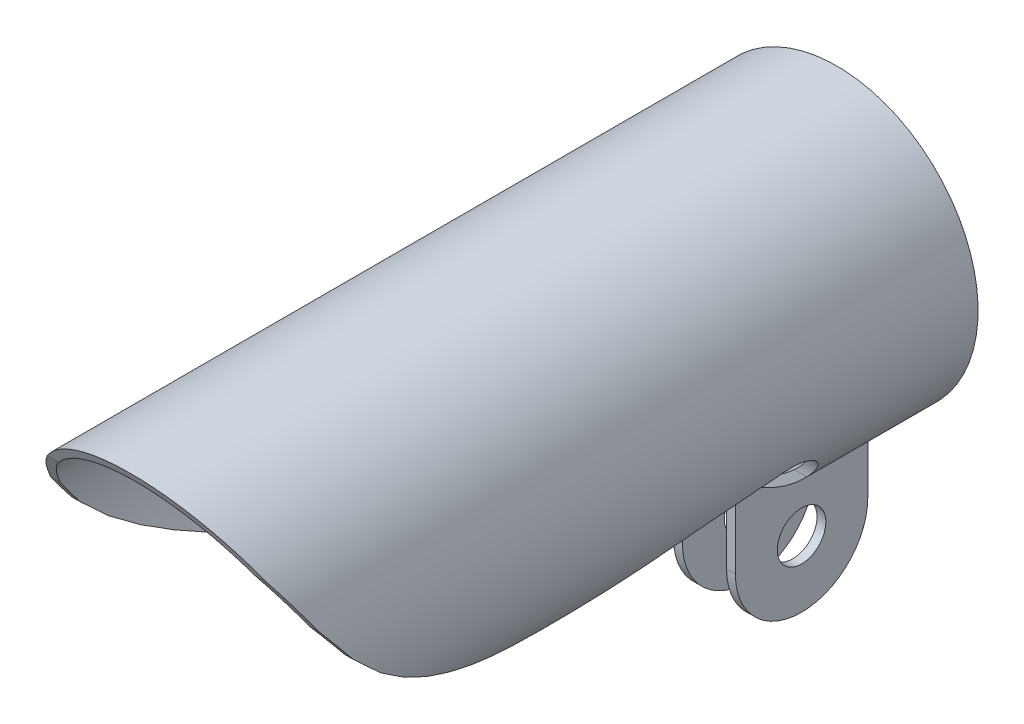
ISO-10303-21;
HEADER;
FILE_DESCRIPTION(('STEP AP214'),'2;1');
FILE_NAME('part.step','',(''),(''),'','','');
FILE_SCHEMA(('AUTOMOTIVE_DESIGN { 1 0 10303 214 1 1 1 1 }'));
ENDSEC;
DATA;
#1=APPLICATION_CONTEXT('core data for automotive mechanical design processes');
#2=APPLICATION_PROTOCOL_DEFINITION('international standard','automotive_design',2000,#1);
#3=PRODUCT_CONTEXT('',#1,'mechanical');
#4=PRODUCT('Part','Part','',(#3));
#5=PRODUCT_RELATED_PRODUCT_CATEGORY('part','',(#4));
#6=PRODUCT_DEFINITION_FORMATION('','',#4);
#7=PRODUCT_DEFINITION_CONTEXT('part definition',#1,'design');
#8=PRODUCT_DEFINITION('design','',#6,#7);
#9=PRODUCT_DEFINITION_SHAPE('','',#8);
#10=(LENGTH_UNIT() NAMED_UNIT(*) SI_UNIT(.MILLI.,.METRE.));
#11=(NAMED_UNIT(*) PLANE_ANGLE_UNIT() SI_UNIT($,.RADIAN.));
#12=(NAMED_UNIT(*) SI_UNIT($,.STERADIAN.) SOLID_ANGLE_UNIT());
#13=UNCERTAINTY_MEASURE_WITH_UNIT(LENGTH_MEASURE(1.E-05),#10,'distance_accuracy_value','');
#14=(GEOMETRIC_REPRESENTATION_CONTEXT(3) GLOBAL_UNCERTAINTY_ASSIGNED_CONTEXT((#13)) GLOBAL_UNIT_ASSIGNED_CONTEXT((#10,
#11,#12)) REPRESENTATION_CONTEXT('',''));
#15=CARTESIAN_POINT('',(0.,0.,0.));
#16=DIRECTION('',(0.,0.,1.));
#17=DIRECTION('',(1.,0.,0.));
#18=AXIS2_PLACEMENT_3D('',#15,#16,#17);
#19=CARTESIAN_POINT('',(359.429971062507,110.991963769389,7.50000000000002));
#20=DIRECTION('',(1.,0.,0.));
#21=DIRECTION('',(0.,0.,-1.));
#22=AXIS2_PLACEMENT_3D('',#19,#20,#21);
#23=CYLINDRICAL_SURFACE('',#22,2.75);
#24=CARTESIAN_POINT('',(421.954199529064,110.991963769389,7.50000000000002));
#25=DIRECTION('',(1.,0.,0.));
#26=DIRECTION('',(0.,0.,-1.));
#27=AXIS2_PLACEMENT_3D('',#24,#25,#26);
#28=CIRCLE('',#27,2.75);
#29=CARTESIAN_POINT('',(421.954199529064,110.991963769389,4.75000000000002));
#30=VERTEX_POINT('',#29);
#31=EDGE_CURVE('E19',#30,#30,#28,.T.);
#32=ORIENTED_EDGE('',*,*,#31,.F.);
#33=EDGE_LOOP('',(#32));
#34=FACE_BOUND('',#33,.T.);
#35=CARTESIAN_POINT('',(422.954199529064,110.991963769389,7.50000000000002));
#36=DIRECTION('',(1.,0.,0.));
#37=DIRECTION('',(0.,0.,-1.));
#38=AXIS2_PLACEMENT_3D('',#35,#36,#37);
#39=CIRCLE('',#38,2.75);
#40=CARTESIAN_POINT('',(422.954199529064,110.991963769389,4.75000000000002));
#41=VERTEX_POINT('',#40);
#42=EDGE_CURVE('E700',#41,#41,#39,.F.);
#43=ORIENTED_EDGE('',*,*,#42,.F.);
#44=EDGE_LOOP('',(#43));
#45=FACE_BOUND('',#44,.T.);
#46=ADVANCED_FACE('F14',(#34,#45),#23,.F.);
#47=CARTESIAN_POINT('',(421.954199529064,110.991963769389,7.5));
#48=DIRECTION('',(1.,0.,0.));
#49=DIRECTION('',(0.,0.,-1.));
#50=AXIS2_PLACEMENT_3D('',#47,#48,#49);
#51=CYLINDRICAL_SURFACE('',#50,7.49999999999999);
#52=DIRECTION('',(-1.,0.,0.));
#53=VECTOR('',#52,1.);
#54=CARTESIAN_POINT('',(359.429971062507,110.991963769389,15.));
#55=LINE('',#54,#53);
#56=CARTESIAN_POINT('',(422.954199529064,110.991963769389,15.));
#57=VERTEX_POINT('',#56);
#58=CARTESIAN_POINT('',(421.954199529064,110.991963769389,15.));
#59=VERTEX_POINT('',#58);
#60=EDGE_CURVE('E332',#57,#59,#55,.T.);
#61=ORIENTED_EDGE('',*,*,#60,.T.);
#62=CARTESIAN_POINT('',(421.954199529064,110.991963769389,7.5));
#63=DIRECTION('',(1.,0.,0.));
#64=DIRECTION('',(0.,0.,-1.));
#65=AXIS2_PLACEMENT_3D('',#62,#63,#64);
#66=CIRCLE('',#65,7.49999999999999);
#67=CARTESIAN_POINT('',(421.954199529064,110.991963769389,0.));
#68=VERTEX_POINT('',#67);
#69=EDGE_CURVE('E330',#68,#59,#66,.F.);
#70=ORIENTED_EDGE('',*,*,#69,.F.);
#71=DIRECTION('',(1.,0.,0.));
#72=VECTOR('',#71,1.);
#73=CARTESIAN_POINT('',(359.429971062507,110.991963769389,0.));
#74=LINE('',#73,#72);
#75=CARTESIAN_POINT('',(422.954199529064,110.991963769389,0.));
#76=VERTEX_POINT('',#75);
#77=EDGE_CURVE('E317',#76,#68,#74,.F.);
#78=ORIENTED_EDGE('',*,*,#77,.F.);
#79=CARTESIAN_POINT('',(422.954199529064,110.991963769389,7.5));
#80=DIRECTION('',(1.,0.,0.));
#81=DIRECTION('',(0.,0.,-1.));
#82=AXIS2_PLACEMENT_3D('',#79,#80,#81);
#83=CIRCLE('',#82,7.49999999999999);
#84=EDGE_CURVE('E468',#57,#76,#83,.T.);
#85=ORIENTED_EDGE('',*,*,#84,.F.);
#86=EDGE_LOOP('',(#61,#70,#78,#85));
#87=FACE_BOUND('',#86,.T.);
#88=ADVANCED_FACE('F331',(#87),#51,.T.);
#89=CARTESIAN_POINT('',(421.954199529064,103.491963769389,0.));
#90=DIRECTION('',(-1.,0.,0.));
#91=DIRECTION('',(0.,0.,1.));
#92=AXIS2_PLACEMENT_3D('',#89,#90,#91);
#93=PLANE('',#92);
#94=DIRECTION('',(0.,0.,1.));
#95=VECTOR('',#94,1.);
#96=CARTESIAN_POINT('',(421.954199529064,120.814259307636,0.));
#97=LINE('',#96,#95);
#98=CARTESIAN_POINT('',(421.954199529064,120.814259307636,0.));
#99=VERTEX_POINT('',#98);
#100=CARTESIAN_POINT('',(421.954199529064,120.814259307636,15.));
#101=VERTEX_POINT('',#100);
#102=EDGE_CURVE('E335',#99,#101,#97,.T.);
#103=ORIENTED_EDGE('',*,*,#102,.F.);
#104=DIRECTION('',(0.,1.,0.));
#105=VECTOR('',#104,1.);
#106=CARTESIAN_POINT('',(421.954199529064,119.778921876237,0.));
#107=LINE('',#106,#105);
#108=EDGE_CURVE('E322',#68,#99,#107,.T.);
#109=ORIENTED_EDGE('',*,*,#108,.F.);
#110=ORIENTED_EDGE('',*,*,#69,.T.);
#111=DIRECTION('',(0.,1.,0.));
#112=VECTOR('',#111,1.);
#113=CARTESIAN_POINT('',(421.954199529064,120.814259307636,15.));
#114=LINE('',#113,#112);
#115=EDGE_CURVE('E479',#59,#101,#114,.T.);
#116=ORIENTED_EDGE('',*,*,#115,.T.);
#117=EDGE_LOOP('',(#103,#109,#110,#116));
#118=FACE_BOUND('',#117,.T.);
#119=ORIENTED_EDGE('',*,*,#31,.T.);
#120=EDGE_LOOP('',(#119));
#121=FACE_BOUND('',#120,.T.);
#122=ADVANCED_FACE('F336',(#118,#121),#93,.T.);
#123=CARTESIAN_POINT('',(419.454199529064,135.604458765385,0.));
#124=DIRECTION('',(0.,0.,1.));
#125=DIRECTION('',(1.,0.,0.));
#126=AXIS2_PLACEMENT_3D('',#123,#124,#125);
#127=CYLINDRICAL_SURFACE('',#126,15.);
#128=CARTESIAN_POINT('',(419.454199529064,135.604458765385,-21.5412997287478));
#129=DIRECTION('',(0.,0.989797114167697,0.142483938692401));
#130=DIRECTION('',(0.,-0.142483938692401,0.989797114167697));
#131=AXIS2_PLACEMENT_3D('',#128,#129,#130);
#132=ELLIPSE('',#131,105.275023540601,15.);
#133=CARTESIAN_POINT('',(405.924975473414,129.126797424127,23.4572493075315));
#134=VERTEX_POINT('',#133);
#135=CARTESIAN_POINT('',(405.756342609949,129.49146311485,20.9240160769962));
#136=VERTEX_POINT('',#135);
#137=EDGE_CURVE('E651',#134,#136,#132,.F.);
#138=ORIENTED_EDGE('',*,*,#137,.T.);
#139=CARTESIAN_POINT('',(405.756342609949,129.49146311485,20.9240160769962));
#140=CARTESIAN_POINT('',(405.745743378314,129.515244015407,20.7976540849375));
#141=CARTESIAN_POINT('',(405.737368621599,129.534147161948,20.67018942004));
#142=CARTESIAN_POINT('',(405.725034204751,129.562079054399,20.4139770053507));
#143=CARTESIAN_POINT('',(405.721074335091,129.571108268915,20.2852293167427));
#144=CARTESIAN_POINT('',(405.717536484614,129.579171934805,20.0274808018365));
#145=CARTESIAN_POINT('',(405.717954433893,129.578215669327,19.8984803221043));
#146=CARTESIAN_POINT('',(405.723167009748,129.56634690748,19.6410291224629));
#147=CARTESIAN_POINT('',(405.727961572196,129.555434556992,19.5125783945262));
#148=CARTESIAN_POINT('',(405.741962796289,129.523762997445,19.2570994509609));
#149=CARTESIAN_POINT('',(405.751170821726,129.50300074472,19.1300716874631));
#150=CARTESIAN_POINT('',(405.774065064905,129.451840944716,18.878333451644));
#151=CARTESIAN_POINT('',(405.787752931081,129.421439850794,18.7536238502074));
#152=CARTESIAN_POINT('',(405.819677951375,129.351355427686,18.5075262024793));
#153=CARTESIAN_POINT('',(405.837912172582,129.311678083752,18.3861360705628));
#154=CARTESIAN_POINT('',(405.879036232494,129.223447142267,18.1473881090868));
#155=CARTESIAN_POINT('',(405.901927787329,129.174890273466,18.0300317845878));
#156=CARTESIAN_POINT('',(405.95252896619,129.069297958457,17.7998648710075));
#157=CARTESIAN_POINT('',(405.980251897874,129.012239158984,17.6870679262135));
#158=CARTESIAN_POINT('',(406.040568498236,128.89035980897,17.4670575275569));
#159=CARTESIAN_POINT('',(406.073163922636,128.825536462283,17.3598461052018));
#160=CARTESIAN_POINT('',(406.143276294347,128.6888809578,17.1517118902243));
#161=CARTESIAN_POINT('',(406.180792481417,128.617049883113,17.0507881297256));
#162=CARTESIAN_POINT('',(406.260794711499,128.467142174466,16.8557217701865));
#163=CARTESIAN_POINT('',(406.30328260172,128.389063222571,16.7615817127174));
#164=CARTESIAN_POINT('',(406.394448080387,128.225304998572,16.5780590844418));
#165=CARTESIAN_POINT('',(406.443264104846,128.139475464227,16.4888794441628));
#166=CARTESIAN_POINT('',(406.546074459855,127.963075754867,16.318492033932));
#167=CARTESIAN_POINT('',(406.600070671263,127.872503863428,16.2372871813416));
#168=CARTESIAN_POINT('',(406.713077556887,127.687671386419,16.0831348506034));
#169=CARTESIAN_POINT('',(406.772084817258,127.593413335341,16.010181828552));
#170=CARTESIAN_POINT('',(406.894980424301,127.402081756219,15.8725149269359));
#171=CARTESIAN_POINT('',(406.958870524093,127.305007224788,15.8078040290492));
#172=CARTESIAN_POINT('',(407.168599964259,126.994614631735,15.6159168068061));
#173=CARTESIAN_POINT('',(407.323169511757,126.777669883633,15.503831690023));
#174=CARTESIAN_POINT('',(407.651982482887,126.342585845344,15.3158577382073));
#175=CARTESIAN_POINT('',(407.826267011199,126.124444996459,15.2400463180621));
#176=CARTESIAN_POINT('',(408.106943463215,125.793088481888,15.1485026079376));
#177=CARTESIAN_POINT('',(408.207513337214,125.677946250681,15.1211940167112));
#178=CARTESIAN_POINT('',(408.413062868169,125.449812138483,15.0752914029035));
#179=CARTESIAN_POINT('',(408.518043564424,125.336820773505,15.0566994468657));
#180=CARTESIAN_POINT('',(408.731397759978,125.114217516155,15.0276196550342));
#181=CARTESIAN_POINT('',(408.839750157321,125.004590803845,15.0170890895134));
#182=CARTESIAN_POINT('',(409.059943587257,124.788577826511,15.0032837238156));
#183=CARTESIAN_POINT('',(409.171782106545,124.682189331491,15.0000038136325));
#184=CARTESIAN_POINT('',(409.285223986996,124.577585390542,15.));
#185=B_SPLINE_CURVE_WITH_KNOTS('',3,(#139,#140,#141,#142,#143,#144,#145,#146,#147,#148,#149,
#150,#151,#152,#153,#154,#155,#156,#157,#158,#159,#160,#161,#162,#163,#164,#165,#166,#167,#168,
#169,#170,#171,#172,#173,#174,#175,#176,#177,#178,#179,#180,#181,#182,#183,#184),.UNSPECIFIED.,
.F.,.F.,(4,2,2,2,2,2,2,2,2,2,2,2,2,2,2,2,2,2,2,2,2,2,4),(0.,0.386932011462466,0.773845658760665,
1.16039963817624,1.54694795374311,1.93361579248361,2.32042607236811,2.70698745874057,
3.09369154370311,3.48147811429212,3.86940475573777,4.2572715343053,4.64528288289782,
5.04399990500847,5.44286224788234,5.84145500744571,6.24019155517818,7.10361949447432,
7.96888202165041,8.43450061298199,8.90022953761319,9.3634724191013,9.82638871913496),.UNSPECIFIED.);
#186=CARTESIAN_POINT('',(409.285223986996,124.577585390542,15.));
#187=VERTEX_POINT('',#186);
#188=EDGE_CURVE('E471',#136,#187,#185,.T.);
#189=ORIENTED_EDGE('',*,*,#188,.T.);
#190=CARTESIAN_POINT('',(419.454199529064,135.604458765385,15.));
#191=DIRECTION('',(0.,0.,1.));
#192=DIRECTION('',(1.,0.,0.));
#193=AXIS2_PLACEMENT_3D('',#190,#191,#192);
#194=CIRCLE('',#193,15.);
#195=CARTESIAN_POINT('',(416.954199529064,120.814259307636,15.));
#196=VERTEX_POINT('',#195);
#197=EDGE_CURVE('E1061',#187,#196,#194,.T.);
#198=ORIENTED_EDGE('',*,*,#197,.T.);
#199=DIRECTION('',(0.,0.,1.));
#200=VECTOR('',#199,1.);
#201=CARTESIAN_POINT('',(416.954199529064,120.814259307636,0.));
#202=LINE('',#201,#200);
#203=CARTESIAN_POINT('',(416.954199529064,120.814259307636,0.));
#204=VERTEX_POINT('',#203);
#205=EDGE_CURVE('E473',#204,#196,#202,.T.);
#206=ORIENTED_EDGE('',*,*,#205,.F.);
#207=CARTESIAN_POINT('',(419.454199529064,135.604458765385,0.));
#208=DIRECTION('',(0.,0.,1.));
#209=DIRECTION('',(1.,0.,0.));
#210=AXIS2_PLACEMENT_3D('',#207,#208,#209);
#211=CIRCLE('',#210,15.);
#212=EDGE_CURVE('E340',#99,#204,#211,.T.);
#213=ORIENTED_EDGE('',*,*,#212,.F.);
#214=ORIENTED_EDGE('',*,*,#102,.T.);
#215=CARTESIAN_POINT('',(419.454199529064,135.604458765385,15.));
#216=DIRECTION('',(0.,0.,1.));
#217=DIRECTION('',(1.,0.,0.));
#218=AXIS2_PLACEMENT_3D('',#215,#216,#217);
#219=CIRCLE('',#218,15.);
#220=CARTESIAN_POINT('',(429.623175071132,124.577585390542,15.));
#221=VERTEX_POINT('',#220);
#222=EDGE_CURVE('E559',#101,#221,#219,.T.);
#223=ORIENTED_EDGE('',*,*,#222,.T.);
#224=CARTESIAN_POINT('',(429.623175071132,124.577585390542,15.));
#225=CARTESIAN_POINT('',(429.778349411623,124.720636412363,15.0000075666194));
#226=CARTESIAN_POINT('',(429.93054832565,124.867102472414,15.0061432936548));
#227=CARTESIAN_POINT('',(430.228367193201,125.165990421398,15.0324685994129));
#228=CARTESIAN_POINT('',(430.373971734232,125.318424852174,15.0526894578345));
#229=CARTESIAN_POINT('',(430.658302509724,125.628850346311,15.1092028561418));
#230=CARTESIAN_POINT('',(430.796971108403,125.786873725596,15.1456110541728));
#231=CARTESIAN_POINT('',(431.065057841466,126.105447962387,15.2362807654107));
#232=CARTESIAN_POINT('',(431.194484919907,126.265996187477,15.2905247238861));
#233=CARTESIAN_POINT('',(431.408136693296,126.542186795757,15.4004552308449));
#234=CARTESIAN_POINT('',(431.494849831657,126.657780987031,15.4514605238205));
#235=CARTESIAN_POINT('',(431.662542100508,126.888001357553,15.5639676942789));
#236=CARTESIAN_POINT('',(431.743522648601,127.002627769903,15.625466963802));
#237=CARTESIAN_POINT('',(431.899143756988,127.229363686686,15.7590880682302));
#238=CARTESIAN_POINT('',(431.973802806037,127.341479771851,15.8311771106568));
#239=CARTESIAN_POINT('',(432.11672757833,127.56221583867,15.9862522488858));
#240=CARTESIAN_POINT('',(432.184993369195,127.670835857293,16.0692382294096));
#241=CARTESIAN_POINT('',(432.315370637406,127.883966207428,16.2467055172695));
#242=CARTESIAN_POINT('',(432.37743116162,127.988438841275,16.3412697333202));
#243=CARTESIAN_POINT('',(432.494626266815,128.190893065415,16.5410648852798));
#244=CARTESIAN_POINT('',(432.549760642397,128.288874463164,16.6462961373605));
#245=CARTESIAN_POINT('',(432.65304784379,128.476912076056,16.8669074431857));
#246=CARTESIAN_POINT('',(432.701196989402,128.566964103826,16.9822927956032));
#247=CARTESIAN_POINT('',(432.790486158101,128.737673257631,17.2223474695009));
#248=CARTESIAN_POINT('',(432.831626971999,128.818331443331,17.3470157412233));
#249=CARTESIAN_POINT('',(432.902962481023,128.960932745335,17.5908438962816));
#250=CARTESIAN_POINT('',(432.933856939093,129.023954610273,17.7091702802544));
#251=CARTESIAN_POINT('',(432.990225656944,129.140698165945,17.9515631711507));
#252=CARTESIAN_POINT('',(433.015700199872,129.194420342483,18.0756293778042));
#253=CARTESIAN_POINT('',(433.061343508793,129.291889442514,18.3285612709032));
#254=CARTESIAN_POINT('',(433.081512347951,129.33563650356,18.4574268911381));
#255=CARTESIAN_POINT('',(433.116659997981,129.41261194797,18.7189476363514));
#256=CARTESIAN_POINT('',(433.131639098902,129.445840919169,18.8516025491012));
#257=CARTESIAN_POINT('',(433.155867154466,129.499941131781,19.1127205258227));
#258=CARTESIAN_POINT('',(433.165372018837,129.521361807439,19.2410464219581));
#259=CARTESIAN_POINT('',(433.179870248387,129.554145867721,19.4992250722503));
#260=CARTESIAN_POINT('',(433.184863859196,129.565509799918,19.6290777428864));
#261=CARTESIAN_POINT('',(433.190372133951,129.578049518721,19.8891604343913));
#262=CARTESIAN_POINT('',(433.190893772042,129.579241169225,20.0193895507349));
#263=CARTESIAN_POINT('',(433.187480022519,129.571463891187,20.2794322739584));
#264=CARTESIAN_POINT('',(433.183547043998,129.5625004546,20.4092460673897));
#265=CARTESIAN_POINT('',(433.174281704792,129.541505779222,20.603107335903));
#266=CARTESIAN_POINT('',(433.170625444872,129.533233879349,20.6676664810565));
#267=CARTESIAN_POINT('',(433.16218660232,129.514204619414,20.7962458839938));
#268=CARTESIAN_POINT('',(433.157405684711,129.503450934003,20.8602667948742));
#269=CARTESIAN_POINT('',(433.152056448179,129.49146311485,20.9240160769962));
#270=B_SPLINE_CURVE_WITH_KNOTS('',3,(#224,#225,#226,#227,#228,#229,#230,#231,#232,#233,#234,
#235,#236,#237,#238,#239,#240,#241,#242,#243,#244,#245,#246,#247,#248,#249,#250,#251,#252,#253,
#254,#255,#256,#257,#258,#259,#260,#261,#262,#263,#264,#265,#266,#267,#268,#269),.UNSPECIFIED.,
.F.,.F.,(4,2,2,2,2,2,2,2,2,2,2,2,2,2,2,2,2,2,2,2,2,2,4),(0.,0.633210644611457,1.26783200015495,
1.90706245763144,2.54566563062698,3.00496676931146,3.46415392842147,3.92194801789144,
4.37973726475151,4.84102081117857,5.30231803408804,5.76385741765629,6.22534468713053,
6.63754950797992,7.04973278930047,7.46191038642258,7.87406494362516,8.26494080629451,
8.65579538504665,9.04604030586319,9.43607427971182,9.63159168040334,9.82682142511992),.UNSPECIFIED.);
#271=CARTESIAN_POINT('',(433.152056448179,129.49146311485,20.9240160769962));
#272=VERTEX_POINT('',#271);
#273=EDGE_CURVE('E552',#221,#272,#270,.T.);
#274=ORIENTED_EDGE('',*,*,#273,.T.);
#275=CARTESIAN_POINT('',(419.454199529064,135.604458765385,-21.5412997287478));
#276=DIRECTION('',(0.,0.989797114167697,0.142483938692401));
#277=DIRECTION('',(0.,-0.142483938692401,0.989797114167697));
#278=AXIS2_PLACEMENT_3D('',#275,#276,#277);
#279=ELLIPSE('',#278,105.275023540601,15.);
#280=CARTESIAN_POINT('',(432.983423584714,129.126797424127,23.4572493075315));
#281=VERTEX_POINT('',#280);
#282=EDGE_CURVE('E561',#272,#281,#279,.F.);
#283=ORIENTED_EDGE('',*,*,#282,.T.);
#284=CARTESIAN_POINT('',(432.983423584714,129.126797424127,23.4572493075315));
#285=CARTESIAN_POINT('',(432.973406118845,129.10587498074,23.5910616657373));
#286=CARTESIAN_POINT('',(432.963329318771,129.084953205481,23.7248696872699));
#287=CARTESIAN_POINT('',(432.943108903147,129.043219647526,23.9917822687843));
#288=CARTESIAN_POINT('',(432.932965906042,129.02240785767,24.1248868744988));
#289=CARTESIAN_POINT('',(432.912614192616,128.98089429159,24.3903926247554));
#290=CARTESIAN_POINT('',(432.902406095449,128.960192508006,24.5227938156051));
#291=CARTESIAN_POINT('',(432.881925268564,128.918898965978,24.7868927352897));
#292=CARTESIAN_POINT('',(432.871653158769,128.89830720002,24.9185905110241));
#293=CARTESIAN_POINT('',(432.851045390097,128.857233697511,25.1812825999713));
#294=CARTESIAN_POINT('',(432.840710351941,128.83675195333,25.3122769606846));
#295=CARTESIAN_POINT('',(432.819977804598,128.795898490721,25.5735622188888));
#296=CARTESIAN_POINT('',(432.809580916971,128.775526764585,25.7038531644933));
#297=CARTESIAN_POINT('',(432.788725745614,128.734893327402,25.963731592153));
#298=CARTESIAN_POINT('',(432.778268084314,128.714631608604,26.0933191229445));
#299=CARTESIAN_POINT('',(432.757292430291,128.674218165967,26.351790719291));
#300=CARTESIAN_POINT('',(432.746775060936,128.654066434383,26.4806748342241));
#301=CARTESIAN_POINT('',(432.736199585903,128.633915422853,26.6095542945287));
#302=B_SPLINE_CURVE_WITH_KNOTS('',3,(#284,#285,#286,#287,#288,#289,#290,#291,#292,#293,#294,
#295,#296,#297,#298,#299,#300,#301),.UNSPECIFIED.,.F.,.F.,(4,2,2,2,2,2,2,2,4),(0.,
0.407424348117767,0.812733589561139,1.21592778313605,1.61700698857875,2.01597126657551,
2.4128206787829,2.80755528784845,3.20017515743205),.UNSPECIFIED.);
#303=CARTESIAN_POINT('',(432.736199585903,128.633915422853,26.6095542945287));
#304=VERTEX_POINT('',#303);
#305=EDGE_CURVE('E481',#281,#304,#302,.T.);
#306=ORIENTED_EDGE('',*,*,#305,.T.);
#307=CARTESIAN_POINT('',(419.454199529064,135.604458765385,-11.0629381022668));
#308=DIRECTION('',(0.,0.983309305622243,0.181941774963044));
#309=DIRECTION('',(0.,-0.181941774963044,0.983309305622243));
#310=AXIS2_PLACEMENT_3D('',#307,#308,#309);
#311=ELLIPSE('',#310,82.4439577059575,15.);
#312=CARTESIAN_POINT('',(432.413361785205,128.050644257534,29.761859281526));
#313=VERTEX_POINT('',#312);
#314=EDGE_CURVE('E563',#304,#313,#311,.F.);
#315=ORIENTED_EDGE('',*,*,#314,.T.);
#316=CARTESIAN_POINT('',(419.454199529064,135.604458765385,-3.1634325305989));
#317=DIRECTION('',(0.,0.974677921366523,0.223613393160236));
#318=DIRECTION('',(0.,-0.223613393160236,0.974677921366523));
#319=AXIS2_PLACEMENT_3D('',#316,#317,#318);
#320=ELLIPSE('',#319,67.0800607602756,15.);
#321=CARTESIAN_POINT('',(431.963829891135,127.327433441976,32.9141642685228));
#322=VERTEX_POINT('',#321);
#323=EDGE_CURVE('E566',#313,#322,#320,.F.);
#324=ORIENTED_EDGE('',*,*,#323,.T.);
#325=CARTESIAN_POINT('',(419.454199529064,135.604458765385,1.34942412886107));
#326=DIRECTION('',(0.,0.967296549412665,0.253648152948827));
#327=DIRECTION('',(0.,-0.253648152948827,0.967296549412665));
#328=AXIS2_PLACEMENT_3D('',#325,#326,#327);
#329=ELLIPSE('',#328,59.1370361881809,15.);
#330=CARTESIAN_POINT('',(431.375769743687,126.500824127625,36.0664692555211));
#331=VERTEX_POINT('',#330);
#332=EDGE_CURVE('E569',#322,#331,#329,.F.);
#333=ORIENTED_EDGE('',*,*,#332,.T.);
#334=CARTESIAN_POINT('',(419.454199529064,135.604458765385,-1.40903401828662));
#335=DIRECTION('',(0.,0.971739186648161,0.23605709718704));
#336=DIRECTION('',(0.,-0.23605709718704,0.971739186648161));
#337=AXIS2_PLACEMENT_3D('',#334,#335,#336);
#338=ELLIPSE('',#337,63.543948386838,15.);
#339=CARTESIAN_POINT('',(430.749992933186,125.735059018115,39.2187742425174));
#340=VERTEX_POINT('',#339);
#341=EDGE_CURVE('E572',#331,#340,#338,.F.);
#342=ORIENTED_EDGE('',*,*,#341,.T.);
#343=CARTESIAN_POINT('',(419.454199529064,135.604458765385,-19.383074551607));
#344=DIRECTION('',(0.,0.986113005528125,0.166075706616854));
#345=DIRECTION('',(0.,-0.166075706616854,0.986113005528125));
#346=AXIS2_PLACEMENT_3D('',#343,#344,#345);
#347=ELLIPSE('',#346,90.320253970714,15.);
#348=CARTESIAN_POINT('',(430.263172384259,125.204165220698,42.3710792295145));
#349=VERTEX_POINT('',#348);
#350=EDGE_CURVE('E461',#340,#349,#347,.F.);
#351=ORIENTED_EDGE('',*,*,#350,.T.);
#352=CARTESIAN_POINT('',(419.454199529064,135.604458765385,-212.158307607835));
#353=DIRECTION('',(0.,0.999166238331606,0.0408268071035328));
#354=DIRECTION('',(0.,-0.0408268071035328,0.999166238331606));
#355=AXIS2_PLACEMENT_3D('',#352,#353,#354);
#356=ELLIPSE('',#355,367.40565976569,15.);
#357=CARTESIAN_POINT('',(430.13774126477,125.075359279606,45.5233842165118));
#358=VERTEX_POINT('',#357);
#359=EDGE_CURVE('E462',#349,#358,#356,.F.);
#360=ORIENTED_EDGE('',*,*,#359,.T.);
#361=CARTESIAN_POINT('',(430.13774126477,125.075359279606,45.5233842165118));
#362=CARTESIAN_POINT('',(430.151008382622,125.088821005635,45.6524527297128));
#363=CARTESIAN_POINT('',(430.164225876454,125.102283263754,45.7815262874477));
#364=CARTESIAN_POINT('',(430.190627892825,125.129275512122,46.0403226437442));
#365=CARTESIAN_POINT('',(430.203811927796,125.142805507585,46.1700454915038));
#366=CARTESIAN_POINT('',(430.230146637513,125.169933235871,46.4301404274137));
#367=CARTESIAN_POINT('',(430.243296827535,125.183530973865,46.5605125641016));
#368=CARTESIAN_POINT('',(430.269563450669,125.210794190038,46.8219060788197));
#369=CARTESIAN_POINT('',(430.282679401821,125.224459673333,46.9529275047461));
#370=CARTESIAN_POINT('',(430.308877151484,125.251858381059,47.2156195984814));
#371=CARTESIAN_POINT('',(430.321958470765,125.265591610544,47.3472903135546));
#372=CARTESIAN_POINT('',(430.348086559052,125.293125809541,47.6112809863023));
#373=CARTESIAN_POINT('',(430.361132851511,125.306926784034,47.7436009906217));
#374=CARTESIAN_POINT('',(430.387190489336,125.334596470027,48.0088902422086));
#375=CARTESIAN_POINT('',(430.400201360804,125.348465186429,48.1418595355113));
#376=CARTESIAN_POINT('',(430.426187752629,125.37627035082,48.4084473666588));
#377=CARTESIAN_POINT('',(430.439162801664,125.390206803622,48.542065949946));
#378=CARTESIAN_POINT('',(430.452089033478,125.404143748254,48.675689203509));
#379=B_SPLINE_CURVE_WITH_KNOTS('',3,(#361,#362,#363,#364,#365,#366,#367,#368,#369,#370,#371,
#372,#373,#374,#375,#376,#377,#378),.UNSPECIFIED.,.F.,.F.,(4,2,2,2,2,2,2,2,4),(0.,
0.391335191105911,0.78460868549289,1.17982059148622,1.57697101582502,1.97606006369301,
2.37708783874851,2.78005444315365,3.18495997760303),.UNSPECIFIED.);
#380=CARTESIAN_POINT('',(430.452089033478,125.404143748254,48.675689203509));
#381=VERTEX_POINT('',#380);
#382=EDGE_CURVE('E487',#358,#381,#379,.T.);
#383=ORIENTED_EDGE('',*,*,#382,.T.);
#384=CARTESIAN_POINT('',(419.454199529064,135.604458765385,94.1374491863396));
#385=DIRECTION('',(0.,0.975740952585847,-0.218928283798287));
#386=DIRECTION('',(0.,0.218928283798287,0.975740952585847));
#387=AXIS2_PLACEMENT_3D('',#384,#385,#386);
#388=ELLIPSE('',#387,68.5155875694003,15.);
#389=CARTESIAN_POINT('',(431.068088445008,126.1114305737,51.8279941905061));
#390=VERTEX_POINT('',#389);
#391=EDGE_CURVE('E578',#381,#390,#388,.F.);
#392=ORIENTED_EDGE('',*,*,#391,.T.);
#393=CARTESIAN_POINT('',(419.454199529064,135.604458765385,81.5884254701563));
#394=DIRECTION('',(0.,0.952705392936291,-0.303895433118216));
#395=DIRECTION('',(0.,0.303895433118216,0.952705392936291));
#396=AXIS2_PLACEMENT_3D('',#393,#394,#395);
#397=ELLIPSE('',#396,49.3590833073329,15.);
#398=CARTESIAN_POINT('',(431.821993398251,127.116957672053,54.9802991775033));
#399=VERTEX_POINT('',#398);
#400=EDGE_CURVE('E582',#390,#399,#397,.F.);
#401=ORIENTED_EDGE('',*,*,#400,.T.);
#402=CARTESIAN_POINT('',(419.454199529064,135.604458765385,76.7109293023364));
#403=DIRECTION('',(0.,0.931472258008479,-0.363812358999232));
#404=DIRECTION('',(0.,0.363812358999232,0.931472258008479));
#405=AXIS2_PLACEMENT_3D('',#402,#403,#404);
#406=ELLIPSE('',#405,41.2300451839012,15.);
#407=CARTESIAN_POINT('',(432.582275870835,128.348177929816,58.1326041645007));
#408=VERTEX_POINT('',#407);
#409=EDGE_CURVE('E585',#399,#408,#406,.F.);
#410=ORIENTED_EDGE('',*,*,#409,.T.);
#411=CARTESIAN_POINT('',(419.454199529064,135.604458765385,73.8006490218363));
#412=DIRECTION('',(0.,0.907410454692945,-0.420245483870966));
#413=DIRECTION('',(0.,0.420245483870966,0.907410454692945));
#414=AXIS2_PLACEMENT_3D('',#411,#412,#413);
#415=ELLIPSE('',#414,35.6934234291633,15.);
#416=CARTESIAN_POINT('',(433.289015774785,129.808092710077,61.2849091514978));
#417=VERTEX_POINT('',#416);
#418=EDGE_CURVE('E588',#408,#417,#415,.F.);
#419=ORIENTED_EDGE('',*,*,#418,.T.);
#420=CARTESIAN_POINT('',(419.454199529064,135.604458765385,71.5969733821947));
#421=DIRECTION('',(0.,0.871726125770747,-0.489993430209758));
#422=DIRECTION('',(0.,0.489993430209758,0.871726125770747));
#423=AXIS2_PLACEMENT_3D('',#420,#421,#422);
#424=ELLIPSE('',#423,30.6126553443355,15.);
#425=CARTESIAN_POINT('',(433.904239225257,131.579989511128,64.437214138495));
#426=VERTEX_POINT('',#425);
#427=EDGE_CURVE('E591',#417,#426,#424,.F.);
#428=ORIENTED_EDGE('',*,*,#427,.T.);
#429=CARTESIAN_POINT('',(419.454199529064,135.604458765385,70.1522780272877));
#430=DIRECTION('',(0.,0.817620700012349,-0.575757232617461));
#431=DIRECTION('',(0.,0.575757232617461,0.817620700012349));
#432=AXIS2_PLACEMENT_3D('',#429,#430,#431);
#433=ELLIPSE('',#432,26.0526471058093,15.);
#434=CARTESIAN_POINT('',(434.345243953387,133.799799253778,67.5895191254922));
#435=VERTEX_POINT('',#434);
#436=EDGE_CURVE('E594',#426,#435,#433,.F.);
#437=ORIENTED_EDGE('',*,*,#436,.T.);
#438=CARTESIAN_POINT('',(419.454199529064,135.604458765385,69.5403514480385));
#439=DIRECTION('',(0.,0.734073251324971,-0.679070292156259));
#440=DIRECTION('',(0.,0.679070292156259,0.734073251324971));
#441=AXIS2_PLACEMENT_3D('',#438,#439,#440);
#442=ELLIPSE('',#441,22.089024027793,15.);
#443=CARTESIAN_POINT('',(434.412965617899,136.715906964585,70.7418241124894));
#444=VERTEX_POINT('',#443);
#445=EDGE_CURVE('E597',#435,#444,#442,.F.);
#446=ORIENTED_EDGE('',*,*,#445,.T.);
#447=CARTESIAN_POINT('',(419.454199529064,135.604458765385,69.8483210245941));
#448=DIRECTION('',(0.,0.626550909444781,-0.779380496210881));
#449=DIRECTION('',(0.,0.779380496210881,0.626550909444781));
#450=AXIS2_PLACEMENT_3D('',#447,#448,#449);
#451=ELLIPSE('',#450,19.2460551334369,15.);
#452=CARTESIAN_POINT('',(433.584742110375,140.637128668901,73.8941290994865));
#453=VERTEX_POINT('',#452);
#454=EDGE_CURVE('E600',#444,#453,#451,.F.);
#455=ORIENTED_EDGE('',*,*,#454,.T.);
#456=CARTESIAN_POINT('',(419.454199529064,135.604458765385,70.7487611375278));
#457=DIRECTION('',(0.,0.529992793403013,-0.848002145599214));
#458=DIRECTION('',(0.,0.848002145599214,0.529992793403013));
#459=AXIS2_PLACEMENT_3D('',#456,#457,#458);
#460=ELLIPSE('',#459,17.6886344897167,15.);
#461=CARTESIAN_POINT('',(430.565696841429,145.680897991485,77.0464340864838));
#462=VERTEX_POINT('',#461);
#463=EDGE_CURVE('E603',#453,#462,#460,.F.);
#464=ORIENTED_EDGE('',*,*,#463,.T.);
#465=CARTESIAN_POINT('',(419.454199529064,135.604458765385,72.0221879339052));
#466=DIRECTION('',(0.,0.446220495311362,-0.894923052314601));
#467=DIRECTION('',(0.,0.894923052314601,0.446220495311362));
#468=AXIS2_PLACEMENT_3D('',#465,#466,#467);
#469=ELLIPSE('',#468,16.7612175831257,15.);
#470=CARTESIAN_POINT('',(408.342702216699,145.680897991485,77.0464340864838));
#471=VERTEX_POINT('',#470);
#472=EDGE_CURVE('E606',#462,#471,#469,.F.);
#473=ORIENTED_EDGE('',*,*,#472,.T.);
#474=CARTESIAN_POINT('',(419.454199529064,135.604458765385,70.7487611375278));
#475=DIRECTION('',(0.,0.529992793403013,-0.848002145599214));
#476=DIRECTION('',(0.,0.848002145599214,0.529992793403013));
#477=AXIS2_PLACEMENT_3D('',#474,#475,#476);
#478=ELLIPSE('',#477,17.6886344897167,15.);
#479=CARTESIAN_POINT('',(405.323656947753,140.637128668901,73.8941290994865));
#480=VERTEX_POINT('',#479);
#481=EDGE_CURVE('E609',#471,#480,#478,.F.);
#482=ORIENTED_EDGE('',*,*,#481,.T.);
#483=CARTESIAN_POINT('',(419.454199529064,135.604458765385,69.8483210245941));
#484=DIRECTION('',(0.,0.626550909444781,-0.779380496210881));
#485=DIRECTION('',(0.,0.779380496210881,0.626550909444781));
#486=AXIS2_PLACEMENT_3D('',#483,#484,#485);
#487=ELLIPSE('',#486,19.2460551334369,15.);
#488=CARTESIAN_POINT('',(404.495433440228,136.715906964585,70.7418241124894));
#489=VERTEX_POINT('',#488);
#490=EDGE_CURVE('E612',#480,#489,#487,.F.);
#491=ORIENTED_EDGE('',*,*,#490,.T.);
#492=CARTESIAN_POINT('',(419.454199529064,135.604458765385,69.5403514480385));
#493=DIRECTION('',(0.,0.734073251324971,-0.679070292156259));
#494=DIRECTION('',(0.,0.679070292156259,0.734073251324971));
#495=AXIS2_PLACEMENT_3D('',#492,#493,#494);
#496=ELLIPSE('',#495,22.089024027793,15.);
#497=CARTESIAN_POINT('',(404.563155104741,133.799799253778,67.5895191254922));
#498=VERTEX_POINT('',#497);
#499=EDGE_CURVE('E615',#489,#498,#496,.F.);
#500=ORIENTED_EDGE('',*,*,#499,.T.);
#501=CARTESIAN_POINT('',(419.454199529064,135.604458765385,70.1522780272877));
#502=DIRECTION('',(0.,0.817620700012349,-0.575757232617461));
#503=DIRECTION('',(0.,0.575757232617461,0.817620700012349));
#504=AXIS2_PLACEMENT_3D('',#501,#502,#503);
#505=ELLIPSE('',#504,26.0526471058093,15.);
#506=CARTESIAN_POINT('',(405.004159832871,131.579989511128,64.437214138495));
#507=VERTEX_POINT('',#506);
#508=EDGE_CURVE('E618',#498,#507,#505,.F.);
#509=ORIENTED_EDGE('',*,*,#508,.T.);
#510=CARTESIAN_POINT('',(419.454199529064,135.604458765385,71.5969733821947));
#511=DIRECTION('',(0.,0.871726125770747,-0.489993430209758));
#512=DIRECTION('',(0.,0.489993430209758,0.871726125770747));
#513=AXIS2_PLACEMENT_3D('',#510,#511,#512);
#514=ELLIPSE('',#513,30.6126553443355,15.);
#515=CARTESIAN_POINT('',(405.619383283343,129.808092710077,61.2849091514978));
#516=VERTEX_POINT('',#515);
#517=EDGE_CURVE('E621',#507,#516,#514,.F.);
#518=ORIENTED_EDGE('',*,*,#517,.T.);
#519=CARTESIAN_POINT('',(419.454199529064,135.604458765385,73.8006490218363));
#520=DIRECTION('',(0.,0.907410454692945,-0.420245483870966));
#521=DIRECTION('',(0.,0.420245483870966,0.907410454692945));
#522=AXIS2_PLACEMENT_3D('',#519,#520,#521);
#523=ELLIPSE('',#522,35.6934234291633,15.);
#524=CARTESIAN_POINT('',(406.326123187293,128.348177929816,58.1326041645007));
#525=VERTEX_POINT('',#524);
#526=EDGE_CURVE('E624',#516,#525,#523,.F.);
#527=ORIENTED_EDGE('',*,*,#526,.T.);
#528=CARTESIAN_POINT('',(419.454199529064,135.604458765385,76.7109293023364));
#529=DIRECTION('',(0.,0.931472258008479,-0.363812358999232));
#530=DIRECTION('',(0.,0.363812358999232,0.931472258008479));
#531=AXIS2_PLACEMENT_3D('',#528,#529,#530);
#532=ELLIPSE('',#531,41.2300451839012,15.);
#533=CARTESIAN_POINT('',(407.086405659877,127.116957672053,54.9802991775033));
#534=VERTEX_POINT('',#533);
#535=EDGE_CURVE('E627',#525,#534,#532,.F.);
#536=ORIENTED_EDGE('',*,*,#535,.T.);
#537=CARTESIAN_POINT('',(419.454199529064,135.604458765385,81.5884254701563));
#538=DIRECTION('',(0.,0.952705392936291,-0.303895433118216));
#539=DIRECTION('',(0.,0.303895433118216,0.952705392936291));
#540=AXIS2_PLACEMENT_3D('',#537,#538,#539);
#541=ELLIPSE('',#540,49.3590833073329,15.);
#542=CARTESIAN_POINT('',(407.84031061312,126.1114305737,51.8279941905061));
#543=VERTEX_POINT('',#542);
#544=EDGE_CURVE('E630',#534,#543,#541,.F.);
#545=ORIENTED_EDGE('',*,*,#544,.T.);
#546=CARTESIAN_POINT('',(419.454199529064,135.604458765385,94.1374491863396));
#547=DIRECTION('',(0.,0.975740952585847,-0.218928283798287));
#548=DIRECTION('',(0.,0.218928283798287,0.975740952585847));
#549=AXIS2_PLACEMENT_3D('',#546,#547,#548);
#550=ELLIPSE('',#549,68.5155875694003,15.);
#551=CARTESIAN_POINT('',(408.45631002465,125.404143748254,48.675689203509));
#552=VERTEX_POINT('',#551);
#553=EDGE_CURVE('E633',#543,#552,#550,.F.);
#554=ORIENTED_EDGE('',*,*,#553,.T.);
#555=CARTESIAN_POINT('',(408.45631002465,125.404143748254,48.675689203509));
#556=CARTESIAN_POINT('',(408.469236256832,125.390206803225,48.5420659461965));
#557=CARTESIAN_POINT('',(408.482211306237,125.376270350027,48.4084473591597));
#558=CARTESIAN_POINT('',(408.508197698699,125.348465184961,48.1418595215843));
#559=CARTESIAN_POINT('',(408.521208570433,125.334596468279,48.0088902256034));
#560=CARTESIAN_POINT('',(408.547266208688,125.306926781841,47.7436009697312));
#561=CARTESIAN_POINT('',(408.560312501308,125.293125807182,47.6112809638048));
#562=CARTESIAN_POINT('',(408.586440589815,125.265591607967,47.3472902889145));
#563=CARTESIAN_POINT('',(408.599521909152,125.251858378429,47.2156195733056));
#564=CARTESIAN_POINT('',(408.625719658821,125.22445967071,46.9529274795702));
#565=CARTESIAN_POINT('',(408.638835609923,125.210794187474,46.8219060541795));
#566=CARTESIAN_POINT('',(408.665102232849,125.18353097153,46.5605125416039));
#567=CARTESIAN_POINT('',(408.678252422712,125.169933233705,46.4301404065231));
#568=CARTESIAN_POINT('',(408.704587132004,125.142805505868,46.1700454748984));
#569=CARTESIAN_POINT('',(408.717771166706,125.129275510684,46.040322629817));
#570=CARTESIAN_POINT('',(408.744173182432,125.102283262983,45.7815262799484));
#571=CARTESIAN_POINT('',(408.757390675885,125.08882100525,45.652452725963));
#572=CARTESIAN_POINT('',(408.770657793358,125.075359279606,45.5233842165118));
#573=B_SPLINE_CURVE_WITH_KNOTS('',3,(#555,#556,#557,#558,#559,#560,#561,#562,#563,#564,#565,
#566,#567,#568,#569,#570,#571,#572),.UNSPECIFIED.,.F.,.F.,(4,2,2,2,2,2,2,2,4),(0.,
0.404905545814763,0.807872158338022,1.2088999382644,1.60798898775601,2.00513941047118,
2.40035131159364,2.79362479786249,3.18495997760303),.UNSPECIFIED.);
#574=CARTESIAN_POINT('',(408.770657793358,125.075359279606,45.5233842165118));
#575=VERTEX_POINT('',#574);
#576=EDGE_CURVE('E465',#552,#575,#573,.T.);
#577=ORIENTED_EDGE('',*,*,#576,.T.);
#578=CARTESIAN_POINT('',(419.454199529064,135.604458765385,-212.158307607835));
#579=DIRECTION('',(0.,0.999166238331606,0.0408268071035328));
#580=DIRECTION('',(0.,-0.0408268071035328,0.999166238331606));
#581=AXIS2_PLACEMENT_3D('',#578,#579,#580);
#582=ELLIPSE('',#581,367.40565976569,15.);
#583=CARTESIAN_POINT('',(408.645226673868,125.204165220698,42.3710792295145));
#584=VERTEX_POINT('',#583);
#585=EDGE_CURVE('E466',#575,#584,#582,.F.);
#586=ORIENTED_EDGE('',*,*,#585,.T.);
#587=CARTESIAN_POINT('',(419.454199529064,135.604458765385,-19.383074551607));
#588=DIRECTION('',(0.,0.986113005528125,0.166075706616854));
#589=DIRECTION('',(0.,-0.166075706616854,0.986113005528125));
#590=AXIS2_PLACEMENT_3D('',#587,#588,#589);
#591=ELLIPSE('',#590,90.320253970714,15.);
#592=CARTESIAN_POINT('',(408.158406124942,125.735059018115,39.2187742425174));
#593=VERTEX_POINT('',#592);
#594=EDGE_CURVE('E638',#584,#593,#591,.F.);
#595=ORIENTED_EDGE('',*,*,#594,.T.);
#596=CARTESIAN_POINT('',(419.454199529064,135.604458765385,-1.40903401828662));
#597=DIRECTION('',(0.,0.971739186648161,0.23605709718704));
#598=DIRECTION('',(0.,-0.23605709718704,0.971739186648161));
#599=AXIS2_PLACEMENT_3D('',#596,#597,#598);
#600=ELLIPSE('',#599,63.543948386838,15.);
#601=CARTESIAN_POINT('',(407.532629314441,126.500824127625,36.0664692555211));
#602=VERTEX_POINT('',#601);
#603=EDGE_CURVE('E641',#593,#602,#600,.F.);
#604=ORIENTED_EDGE('',*,*,#603,.T.);
#605=CARTESIAN_POINT('',(419.454199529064,135.604458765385,1.34942412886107));
#606=DIRECTION('',(0.,0.967296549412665,0.253648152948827));
#607=DIRECTION('',(0.,-0.253648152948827,0.967296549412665));
#608=AXIS2_PLACEMENT_3D('',#605,#606,#607);
#609=ELLIPSE('',#608,59.1370361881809,15.);
#610=CARTESIAN_POINT('',(406.944569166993,127.327433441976,32.9141642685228));
#611=VERTEX_POINT('',#610);
#612=EDGE_CURVE('E644',#602,#611,#609,.F.);
#613=ORIENTED_EDGE('',*,*,#612,.T.);
#614=CARTESIAN_POINT('',(419.454199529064,135.604458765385,-3.1634325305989));
#615=DIRECTION('',(0.,0.974677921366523,0.223613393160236));
#616=DIRECTION('',(0.,-0.223613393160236,0.974677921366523));
#617=AXIS2_PLACEMENT_3D('',#614,#615,#616);
#618=ELLIPSE('',#617,67.0800607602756,15.);
#619=CARTESIAN_POINT('',(406.495037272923,128.050644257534,29.761859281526));
#620=VERTEX_POINT('',#619);
#621=EDGE_CURVE('E647',#611,#620,#618,.F.);
#622=ORIENTED_EDGE('',*,*,#621,.T.);
#623=CARTESIAN_POINT('',(419.454199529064,135.604458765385,-11.0629381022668));
#624=DIRECTION('',(0.,0.983309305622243,0.181941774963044));
#625=DIRECTION('',(0.,-0.181941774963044,0.983309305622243));
#626=AXIS2_PLACEMENT_3D('',#623,#624,#625);
#627=ELLIPSE('',#626,82.4439577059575,15.);
#628=CARTESIAN_POINT('',(406.172199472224,128.633915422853,26.6095542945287));
#629=VERTEX_POINT('',#628);
#630=EDGE_CURVE('E650',#620,#629,#627,.F.);
#631=ORIENTED_EDGE('',*,*,#630,.T.);
#632=CARTESIAN_POINT('',(406.172199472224,128.633915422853,26.6095542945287));
#633=CARTESIAN_POINT('',(406.161623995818,128.654066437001,26.4806748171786));
#634=CARTESIAN_POINT('',(406.151106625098,128.674218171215,26.3517906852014));
#635=CARTESIAN_POINT('',(406.130130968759,128.714631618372,26.0933190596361));
#636=CARTESIAN_POINT('',(406.119673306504,128.73489333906,25.9637315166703));
#637=CARTESIAN_POINT('',(406.098818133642,128.775526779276,25.7038530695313));
#638=CARTESIAN_POINT('',(406.088421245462,128.795898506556,25.5735621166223));
#639=CARTESIAN_POINT('',(406.067688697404,128.836751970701,25.3122768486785));
#640=CARTESIAN_POINT('',(406.057353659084,128.857233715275,25.1812824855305));
#641=CARTESIAN_POINT('',(406.036745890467,128.898307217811,24.9185903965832));
#642=CARTESIAN_POINT('',(406.026473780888,128.918898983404,24.7868926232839));
#643=CARTESIAN_POINT('',(406.005992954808,128.960192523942,24.5227937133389));
#644=CARTESIAN_POINT('',(405.995784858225,128.9808943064,24.3903925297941));
#645=CARTESIAN_POINT('',(405.975433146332,129.02240786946,24.1248867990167));
#646=CARTESIAN_POINT('',(405.96529015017,129.043219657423,23.9917822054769));
#647=CARTESIAN_POINT('',(405.945069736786,129.08495321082,23.7248696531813));
#648=CARTESIAN_POINT('',(405.934992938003,129.105874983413,23.5910616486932));
#649=CARTESIAN_POINT('',(405.924975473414,129.126797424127,23.4572493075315));
#650=B_SPLINE_CURVE_WITH_KNOTS('',3,(#632,#633,#634,#635,#636,#637,#638,#639,#640,#641,#642,
#643,#644,#645,#646,#647,#648,#649),.UNSPECIFIED.,.F.,.F.,(4,2,2,2,2,2,2,2,4),(0.,
0.392619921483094,0.787354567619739,1.18420400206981,1.5831682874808,1.98424748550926,
2.38744165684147,2.79275086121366,3.20017515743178),.UNSPECIFIED.);
#651=EDGE_CURVE('E519',#629,#134,#650,.T.);
#652=ORIENTED_EDGE('',*,*,#651,.T.);
#653=EDGE_LOOP('',(#138,#189,#198,#206,#213,#214,#223,#274,#283,#306,#315,#324,#333,#342,#351,
#360,#383,#392,#401,#410,#419,#428,#437,#446,#455,#464,#473,#482,#491,#500,#509,#518,#527,#536,
#545,#554,#577,#586,#595,#604,#613,#622,#631,#652));
#654=FACE_BOUND('',#653,.T.);
#655=ADVANCED_FACE('F490',(#654),#127,.F.);
#656=CARTESIAN_POINT('',(416.954199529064,120.814259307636,0.));
#657=DIRECTION('',(1.,0.,0.));
#658=DIRECTION('',(0.,1.,0.));
#659=AXIS2_PLACEMENT_3D('',#656,#657,#658);
#660=PLANE('',#659);
#661=ORIENTED_EDGE('',*,*,#205,.T.);
#662=DIRECTION('',(0.,1.,0.));
#663=VECTOR('',#662,1.);
#664=CARTESIAN_POINT('',(416.954199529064,120.814259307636,15.));
#665=LINE('',#664,#663);
#666=CARTESIAN_POINT('',(416.954199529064,110.991963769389,15.));
#667=VERTEX_POINT('',#666);
#668=EDGE_CURVE('E472',#196,#667,#665,.F.);
#669=ORIENTED_EDGE('',*,*,#668,.T.);
#670=CARTESIAN_POINT('',(416.954199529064,110.991963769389,7.5));
#671=DIRECTION('',(1.,0.,0.));
#672=DIRECTION('',(0.,0.,-1.));
#673=AXIS2_PLACEMENT_3D('',#670,#671,#672);
#674=CIRCLE('',#673,7.49999999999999);
#675=CARTESIAN_POINT('',(416.954199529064,110.991963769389,0.));
#676=VERTEX_POINT('',#675);
#677=EDGE_CURVE('E1065',#667,#676,#674,.T.);
#678=ORIENTED_EDGE('',*,*,#677,.T.);
#679=DIRECTION('',(0.,1.,0.));
#680=VECTOR('',#679,1.);
#681=CARTESIAN_POINT('',(416.954199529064,119.778921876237,0.));
#682=LINE('',#681,#680);
#683=EDGE_CURVE('E342',#204,#676,#682,.F.);
#684=ORIENTED_EDGE('',*,*,#683,.F.);
#685=EDGE_LOOP('',(#661,#669,#678,#684));
#686=FACE_BOUND('',#685,.T.);
#687=CARTESIAN_POINT('',(416.954199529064,110.991963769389,7.50000000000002));
#688=DIRECTION('',(1.,0.,0.));
#689=DIRECTION('',(0.,0.,-1.));
#690=AXIS2_PLACEMENT_3D('',#687,#688,#689);
#691=CIRCLE('',#690,2.75);
#692=CARTESIAN_POINT('',(416.954199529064,110.991963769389,4.75000000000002));
#693=VERTEX_POINT('',#692);
#694=EDGE_CURVE('E476',#693,#693,#691,.F.);
#695=ORIENTED_EDGE('',*,*,#694,.T.);
#696=EDGE_LOOP('',(#695));
#697=FACE_BOUND('',#696,.T.);
#698=ADVANCED_FACE('F500',(#686,#697),#660,.T.);
#699=CARTESIAN_POINT('',(359.429971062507,110.991963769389,7.50000000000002));
#700=DIRECTION('',(1.,0.,0.));
#701=DIRECTION('',(0.,0.,-1.));
#702=AXIS2_PLACEMENT_3D('',#699,#700,#701);
#703=CYLINDRICAL_SURFACE('',#702,2.75);
#704=ORIENTED_EDGE('',*,*,#694,.F.);
#705=EDGE_LOOP('',(#704));
#706=FACE_BOUND('',#705,.T.);
#707=CARTESIAN_POINT('',(415.954199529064,110.991963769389,7.50000000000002));
#708=DIRECTION('',(1.,0.,0.));
#709=DIRECTION('',(0.,0.,-1.));
#710=AXIS2_PLACEMENT_3D('',#707,#708,#709);
#711=CIRCLE('',#710,2.75);
#712=CARTESIAN_POINT('',(415.954199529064,110.991963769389,4.75000000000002));
#713=VERTEX_POINT('',#712);
#714=EDGE_CURVE('E354',#713,#713,#711,.T.);
#715=ORIENTED_EDGE('',*,*,#714,.F.);
#716=EDGE_LOOP('',(#715));
#717=FACE_BOUND('',#716,.T.);
#718=ADVANCED_FACE('F1072',(#706,#717),#703,.F.);
#719=CARTESIAN_POINT('',(415.954199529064,110.991963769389,7.5));
#720=DIRECTION('',(1.,0.,0.));
#721=DIRECTION('',(0.,0.,-1.));
#722=AXIS2_PLACEMENT_3D('',#719,#720,#721);
#723=CYLINDRICAL_SURFACE('',#722,7.49999999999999);
#724=DIRECTION('',(-1.,0.,0.));
#725=VECTOR('',#724,1.);
#726=CARTESIAN_POINT('',(419.454199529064,110.991963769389,0.));
#727=LINE('',#726,#725);
#728=CARTESIAN_POINT('',(415.954199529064,110.991963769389,0.));
#729=VERTEX_POINT('',#728);
#730=EDGE_CURVE('E344',#676,#729,#727,.T.);
#731=ORIENTED_EDGE('',*,*,#730,.F.);
#732=ORIENTED_EDGE('',*,*,#677,.F.);
#733=DIRECTION('',(-1.,0.,0.));
#734=VECTOR('',#733,1.);
#735=CARTESIAN_POINT('',(359.429971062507,110.991963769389,15.));
#736=LINE('',#735,#734);
#737=CARTESIAN_POINT('',(415.954199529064,110.991963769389,15.));
#738=VERTEX_POINT('',#737);
#739=EDGE_CURVE('E469',#667,#738,#736,.T.);
#740=ORIENTED_EDGE('',*,*,#739,.T.);
#741=CARTESIAN_POINT('',(415.954199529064,110.991963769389,7.5));
#742=DIRECTION('',(1.,0.,0.));
#743=DIRECTION('',(0.,0.,-1.));
#744=AXIS2_PLACEMENT_3D('',#741,#742,#743);
#745=CIRCLE('',#744,7.49999999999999);
#746=EDGE_CURVE('E350',#729,#738,#745,.F.);
#747=ORIENTED_EDGE('',*,*,#746,.F.);
#748=EDGE_LOOP('',(#731,#732,#740,#747));
#749=FACE_BOUND('',#748,.T.);
#750=ADVANCED_FACE('F1075',(#749),#723,.T.);
#751=CARTESIAN_POINT('',(359.429971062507,120.814259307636,15.));
#752=DIRECTION('',(0.,0.,-1.));
#753=DIRECTION('',(-1.,0.,0.));
#754=AXIS2_PLACEMENT_3D('',#751,#752,#753);
#755=PLANE('',#754);
#756=DIRECTION('',(0.,-1.,0.));
#757=VECTOR('',#756,1.);
#758=CARTESIAN_POINT('',(415.954199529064,103.491963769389,15.));
#759=LINE('',#758,#757);
#760=CARTESIAN_POINT('',(415.954199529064,119.991963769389,15.));
#761=VERTEX_POINT('',#760);
#762=EDGE_CURVE('E351',#738,#761,#759,.F.);
#763=ORIENTED_EDGE('',*,*,#762,.F.);
#764=ORIENTED_EDGE('',*,*,#739,.F.);
#765=ORIENTED_EDGE('',*,*,#668,.F.);
#766=ORIENTED_EDGE('',*,*,#197,.F.);
#767=DIRECTION('',(1.,0.,0.));
#768=VECTOR('',#767,1.);
#769=CARTESIAN_POINT('',(359.429971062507,124.577585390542,15.));
#770=LINE('',#769,#768);
#771=CARTESIAN_POINT('',(407.860750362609,124.577585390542,15.));
#772=VERTEX_POINT('',#771);
#773=EDGE_CURVE('E652',#187,#772,#770,.F.);
#774=ORIENTED_EDGE('',*,*,#773,.T.);
#775=CARTESIAN_POINT('',(419.454199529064,135.604458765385,15.));
#776=DIRECTION('',(0.,0.,1.));
#777=DIRECTION('',(1.,0.,0.));
#778=AXIS2_PLACEMENT_3D('',#775,#776,#777);
#779=CIRCLE('',#778,16.);
#780=EDGE_CURVE('E714',#761,#772,#779,.F.);
#781=ORIENTED_EDGE('',*,*,#780,.F.);
#782=EDGE_LOOP('',(#763,#764,#765,#766,#774,#781));
#783=FACE_BOUND('',#782,.T.);
#784=ADVANCED_FACE('F730',(#783),#755,.F.);
#785=CARTESIAN_POINT('',(359.429971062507,124.577585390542,20.));
#786=DIRECTION('',(1.,0.,0.));
#787=DIRECTION('',(0.,0.,-1.));
#788=AXIS2_PLACEMENT_3D('',#785,#786,#787);
#789=CYLINDRICAL_SURFACE('',#788,5.);
#790=ORIENTED_EDGE('',*,*,#773,.F.);
#791=ORIENTED_EDGE('',*,*,#188,.F.);
#792=DIRECTION('',(1.,0.,0.));
#793=VECTOR('',#792,1.);
#794=CARTESIAN_POINT('',(359.429971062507,129.49146311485,20.9240160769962));
#795=LINE('',#794,#793);
#796=CARTESIAN_POINT('',(404.668013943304,129.49146311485,20.9240160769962));
#797=VERTEX_POINT('',#796);
#798=EDGE_CURVE('E523',#136,#797,#795,.F.);
#799=ORIENTED_EDGE('',*,*,#798,.T.);
#800=CARTESIAN_POINT('',(407.860750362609,124.577585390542,15.));
#801=CARTESIAN_POINT('',(407.714801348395,124.730972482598,15.0000005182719));
#802=CARTESIAN_POINT('',(407.57186360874,124.887411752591,15.0070625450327));
#803=CARTESIAN_POINT('',(407.292690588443,125.205314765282,15.0369849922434));
#804=CARTESIAN_POINT('',(407.156471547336,125.366789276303,15.0598818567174));
#805=CARTESIAN_POINT('',(406.891322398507,125.693919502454,15.1233505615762));
#806=CARTESIAN_POINT('',(406.762439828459,125.859594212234,15.1640254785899));
#807=CARTESIAN_POINT('',(406.514049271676,126.191943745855,15.2646079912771));
#808=CARTESIAN_POINT('',(406.394531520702,126.35861732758,15.3244952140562));
#809=CARTESIAN_POINT('',(406.199622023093,126.641401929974,15.4440390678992));
#810=CARTESIAN_POINT('',(406.121621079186,126.757911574,15.4985428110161));
#811=CARTESIAN_POINT('',(405.971097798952,126.989067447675,15.6180289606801));
#812=CARTESIAN_POINT('',(405.898574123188,127.103714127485,15.6830087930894));
#813=CARTESIAN_POINT('',(405.759485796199,127.329655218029,15.8234277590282));
#814=CARTESIAN_POINT('',(405.692905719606,127.440957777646,15.898838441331));
#815=CARTESIAN_POINT('',(405.565758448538,127.659199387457,16.0601953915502));
#816=CARTESIAN_POINT('',(405.505188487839,127.766140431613,16.1461367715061));
#817=CARTESIAN_POINT('',(405.389817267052,127.975075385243,16.3289704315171));
#818=CARTESIAN_POINT('',(405.335057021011,128.077031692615,16.4259316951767));
#819=CARTESIAN_POINT('',(405.231863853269,128.27387068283,16.6299019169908));
#820=CARTESIAN_POINT('',(405.183431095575,128.368753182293,16.7369111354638));
#821=CARTESIAN_POINT('',(405.092883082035,128.550177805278,16.9603888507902));
#822=CARTESIAN_POINT('',(405.05077155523,128.636714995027,17.0768628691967));
#823=CARTESIAN_POINT('',(404.972845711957,128.800151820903,17.3183614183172));
#824=CARTESIAN_POINT('',(404.937030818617,128.877052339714,17.4433851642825));
#825=CARTESIAN_POINT('',(404.874593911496,129.013540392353,17.6891118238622));
#826=CARTESIAN_POINT('',(404.847429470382,129.074069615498,17.8091553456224));
#827=CARTESIAN_POINT('',(404.798088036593,129.185571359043,18.0545875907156));
#828=CARTESIAN_POINT('',(404.77591085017,129.23654425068,18.1799761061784));
#829=CARTESIAN_POINT('',(404.736425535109,129.328343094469,18.435170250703));
#830=CARTESIAN_POINT('',(404.719117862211,129.369168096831,18.5649762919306));
#831=CARTESIAN_POINT('',(404.689264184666,129.440193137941,18.8279934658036));
#832=CARTESIAN_POINT('',(404.676717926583,129.470393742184,18.961204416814));
#833=CARTESIAN_POINT('',(404.656708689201,129.518826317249,19.2245449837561));
#834=CARTESIAN_POINT('',(404.649060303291,129.537493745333,19.3545806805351));
#835=CARTESIAN_POINT('',(404.638005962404,129.564539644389,19.6158930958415));
#836=CARTESIAN_POINT('',(404.634599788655,129.572918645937,19.7471697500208));
#837=CARTESIAN_POINT('',(404.632005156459,129.579297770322,20.009769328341));
#838=CARTESIAN_POINT('',(404.632808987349,129.577316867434,20.141091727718));
#839=CARTESIAN_POINT('',(404.638622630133,129.563039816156,20.403024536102));
#840=CARTESIAN_POINT('',(404.643629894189,129.550749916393,20.5336353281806));
#841=CARTESIAN_POINT('',(404.653151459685,129.527534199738,20.7070721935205));
#842=CARTESIAN_POINT('',(404.65578842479,129.521113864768,20.7506435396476));
#843=CARTESIAN_POINT('',(404.661541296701,129.507138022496,20.8375219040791));
#844=CARTESIAN_POINT('',(404.664656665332,129.499583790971,20.880829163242));
#845=CARTESIAN_POINT('',(404.668013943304,129.49146311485,20.9240160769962));
#846=B_SPLINE_CURVE_WITH_KNOTS('',3,(#800,#801,#802,#803,#804,#805,#806,#807,#808,#809,#810,
#811,#812,#813,#814,#815,#816,#817,#818,#819,#820,#821,#822,#823,#824,#825,#826,#827,#828,#829,
#830,#831,#832,#833,#834,#835,#836,#837,#838,#839,#840,#841,#842,#843,#844,#845),.UNSPECIFIED.,
.F.,.F.,(4,2,2,2,2,2,2,2,2,2,2,2,2,2,2,2,2,2,2,2,2,2,4),(0.,0.635229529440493,1.27192593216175,
1.91236389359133,2.55212496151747,3.00298842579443,3.45374127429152,3.90328804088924,
4.35262692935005,4.8049521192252,5.25728903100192,5.70989174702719,6.16245297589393,
6.57340989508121,6.98435084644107,7.39533024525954,7.80628776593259,8.20059010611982,
8.59487211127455,8.9884322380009,9.38175398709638,9.5141030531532,9.64630431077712),.UNSPECIFIED.);
#847=EDGE_CURVE('E717',#772,#797,#846,.T.);
#848=ORIENTED_EDGE('',*,*,#847,.F.);
#849=EDGE_LOOP('',(#790,#791,#799,#848));
#850=FACE_BOUND('',#849,.T.);
#851=ADVANCED_FACE('F724',(#850),#789,.F.);
#852=CARTESIAN_POINT('',(359.429971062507,129.126797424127,23.4572493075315));
#853=DIRECTION('',(0.,0.989797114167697,0.142483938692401));
#854=DIRECTION('',(0.,-0.142483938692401,0.989797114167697));
#855=AXIS2_PLACEMENT_3D('',#852,#853,#854);
#856=PLANE('',#855);
#857=ORIENTED_EDGE('',*,*,#798,.F.);
#858=ORIENTED_EDGE('',*,*,#137,.F.);
#859=DIRECTION('',(1.,0.,0.));
#860=VECTOR('',#859,1.);
#861=CARTESIAN_POINT('',(359.429971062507,129.126797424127,23.4572493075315));
#862=LINE('',#861,#860);
#863=CARTESIAN_POINT('',(404.824096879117,129.126797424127,23.4572493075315));
#864=VERTEX_POINT('',#863);
#865=EDGE_CURVE('E522',#134,#864,#862,.F.);
#866=ORIENTED_EDGE('',*,*,#865,.T.);
#867=CARTESIAN_POINT('',(419.454199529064,135.604458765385,-21.5412997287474));
#868=DIRECTION('',(0.,0.989797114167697,0.142483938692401));
#869=DIRECTION('',(0.,-0.142483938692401,0.989797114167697));
#870=AXIS2_PLACEMENT_3D('',#867,#868,#869);
#871=ELLIPSE('',#870,112.293358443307,16.);
#872=EDGE_CURVE('E360',#797,#864,#871,.T.);
#873=ORIENTED_EDGE('',*,*,#872,.F.);
#874=EDGE_LOOP('',(#857,#858,#866,#873));
#875=FACE_BOUND('',#874,.T.);
#876=ADVANCED_FACE('F729',(#875),#856,.F.);
#877=CARTESIAN_POINT('',(359.429971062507,128.633915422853,26.6095542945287));
#878=DIRECTION('',(0.,0.987996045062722,0.154479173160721));
#879=DIRECTION('',(0.,-0.154479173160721,0.987996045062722));
#880=AXIS2_PLACEMENT_3D('',#877,#878,#879);
#881=PLANE('',#880);
#882=ORIENTED_EDGE('',*,*,#865,.F.);
#883=ORIENTED_EDGE('',*,*,#651,.F.);
#884=DIRECTION('',(1.,0.,0.));
#885=VECTOR('',#884,1.);
#886=CARTESIAN_POINT('',(359.429971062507,128.633915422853,26.6095542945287));
#887=LINE('',#886,#885);
#888=CARTESIAN_POINT('',(405.052410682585,128.633915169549,26.6095556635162));
#889=VERTEX_POINT('',#888);
#890=EDGE_CURVE('E649',#629,#889,#887,.F.);
#891=ORIENTED_EDGE('',*,*,#890,.T.);
#892=CARTESIAN_POINT('',(404.824096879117,129.126797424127,23.4572493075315));
#893=CARTESIAN_POINT('',(404.833349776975,129.105899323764,23.590906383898));
#894=CARTESIAN_POINT('',(404.842655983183,129.085001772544,23.72455985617));
#895=CARTESIAN_POINT('',(404.861329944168,129.043309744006,23.9912075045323));
#896=CARTESIAN_POINT('',(404.870697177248,129.022515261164,24.1242017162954));
#897=CARTESIAN_POINT('',(404.889492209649,128.981029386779,24.3895308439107));
#898=CARTESIAN_POINT('',(404.898919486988,128.960337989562,24.5218657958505));
#899=CARTESIAN_POINT('',(404.917833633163,128.919058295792,24.7858764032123));
#900=CARTESIAN_POINT('',(404.927319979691,128.898469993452,24.9175520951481));
#901=CARTESIAN_POINT('',(404.946351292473,128.857396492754,25.180244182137));
#902=CARTESIAN_POINT('',(404.955895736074,128.836911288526,25.3112606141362));
#903=CARTESIAN_POINT('',(404.975042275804,128.79604398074,25.5726341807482));
#904=CARTESIAN_POINT('',(404.984643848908,128.775661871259,25.7029913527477));
#905=CARTESIAN_POINT('',(405.003903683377,128.735000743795,25.9630463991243));
#906=CARTESIAN_POINT('',(405.013561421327,128.714721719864,26.0927443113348));
#907=CARTESIAN_POINT('',(405.032932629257,128.674266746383,26.351480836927));
#908=CARTESIAN_POINT('',(405.042645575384,128.654090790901,26.4805194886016));
#909=CARTESIAN_POINT('',(405.052410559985,128.633915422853,26.6095542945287));
#910=B_SPLINE_CURVE_WITH_KNOTS('',3,(#892,#893,#894,#895,#896,#897,#898,#899,#900,#901,#902,
#903,#904,#905,#906,#907,#908,#909),.UNSPECIFIED.,.F.,.F.,(4,2,2,2,2,2,2,2,4),(0.,
0.406791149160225,0.811597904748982,1.21442030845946,1.61525840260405,2.01411223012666,
2.41098183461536,2.80586726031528,3.19876855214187),.UNSPECIFIED.);
#911=EDGE_CURVE('E355',#864,#889,#910,.T.);
#912=ORIENTED_EDGE('',*,*,#911,.F.);
#913=EDGE_LOOP('',(#882,#883,#891,#912));
#914=FACE_BOUND('',#913,.T.);
#915=ADVANCED_FACE('F736',(#914),#881,.F.);
#916=CARTESIAN_POINT('',(359.429971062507,128.050644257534,29.7618592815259));
#917=DIRECTION('',(0.,0.983309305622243,0.181941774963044));
#918=DIRECTION('',(0.,-0.181941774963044,0.983309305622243));
#919=AXIS2_PLACEMENT_3D('',#916,#917,#918);
#920=PLANE('',#919);
#921=ORIENTED_EDGE('',*,*,#890,.F.);
#922=ORIENTED_EDGE('',*,*,#630,.F.);
#923=DIRECTION('',(1.,0.,0.));
#924=VECTOR('',#923,1.);
#925=CARTESIAN_POINT('',(359.429971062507,128.050644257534,29.7618592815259));
#926=LINE('',#925,#924);
#927=CARTESIAN_POINT('',(405.349594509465,128.050644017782,29.7618603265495));
#928=VERTEX_POINT('',#927);
#929=EDGE_CURVE('E646',#620,#928,#926,.F.);
#930=ORIENTED_EDGE('',*,*,#929,.T.);
#931=CARTESIAN_POINT('',(405.052410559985,128.633915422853,26.6095542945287));
#932=CARTESIAN_POINT('',(405.064418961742,128.609104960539,26.7436430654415));
#933=CARTESIAN_POINT('',(405.076505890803,128.584295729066,26.8777250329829));
#934=CARTESIAN_POINT('',(405.100768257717,128.5348218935,27.1451072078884));
#935=CARTESIAN_POINT('',(405.112942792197,128.510157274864,27.2784074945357));
#936=CARTESIAN_POINT('',(405.137378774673,128.460972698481,27.5442263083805));
#937=CARTESIAN_POINT('',(405.149639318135,128.436452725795,27.6767449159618));
#938=CARTESIAN_POINT('',(405.174245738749,128.387557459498,27.9410003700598));
#939=CARTESIAN_POINT('',(405.186590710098,128.363182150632,28.0727372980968));
#940=CARTESIAN_POINT('',(405.211364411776,128.31457621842,28.3354293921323));
#941=CARTESIAN_POINT('',(405.223792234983,128.290345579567,28.4663846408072));
#942=CARTESIAN_POINT('',(405.248730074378,128.242028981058,28.7275133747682));
#943=CARTESIAN_POINT('',(405.261239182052,128.217943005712,28.8576869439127));
#944=CARTESIAN_POINT('',(405.286338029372,128.169915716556,29.1172523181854));
#945=CARTESIAN_POINT('',(405.298926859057,128.145974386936,29.2466442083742));
#946=CARTESIAN_POINT('',(405.324183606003,128.098236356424,29.5046462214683));
#947=CARTESIAN_POINT('',(405.336850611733,128.074439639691,29.6332564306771));
#948=CARTESIAN_POINT('',(405.349594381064,128.050644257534,29.7618592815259));
#949=B_SPLINE_CURVE_WITH_KNOTS('',3,(#931,#932,#933,#934,#935,#936,#937,#938,#939,#940,#941,
#942,#943,#944,#945,#946,#947,#948),.UNSPECIFIED.,.F.,.F.,(4,2,2,2,2,2,2,2,4),(0.,
0.410677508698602,0.81900297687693,1.22497650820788,1.62859820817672,2.02986818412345,
2.42878654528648,2.82535340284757,3.21956886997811),.UNSPECIFIED.);
#950=EDGE_CURVE('E359',#889,#928,#949,.T.);
#951=ORIENTED_EDGE('',*,*,#950,.F.);
#952=EDGE_LOOP('',(#921,#922,#930,#951));
#953=FACE_BOUND('',#952,.T.);
#954=ADVANCED_FACE('F740',(#953),#920,.F.);
#955=CARTESIAN_POINT('',(359.429971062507,127.327433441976,32.9141642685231));
#956=DIRECTION('',(0.,0.974677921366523,0.223613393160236));
#957=DIRECTION('',(0.,-0.223613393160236,0.974677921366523));
#958=AXIS2_PLACEMENT_3D('',#955,#956,#957);
#959=PLANE('',#958);
#960=ORIENTED_EDGE('',*,*,#929,.F.);
#961=ORIENTED_EDGE('',*,*,#621,.F.);
#962=DIRECTION('',(1.,0.,0.));
#963=VECTOR('',#962,1.);
#964=CARTESIAN_POINT('',(359.429971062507,127.327433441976,32.9141642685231));
#965=LINE('',#964,#963);
#966=CARTESIAN_POINT('',(405.761469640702,127.327433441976,32.9141642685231));
#967=VERTEX_POINT('',#966);
#968=EDGE_CURVE('E643',#611,#967,#965,.F.);
#969=ORIENTED_EDGE('',*,*,#968,.T.);
#970=CARTESIAN_POINT('',(405.349594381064,128.050644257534,29.7618592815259));
#971=CARTESIAN_POINT('',(405.36615873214,128.019715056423,29.896672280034));
#972=CARTESIAN_POINT('',(405.38285215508,127.988789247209,30.0314702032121));
#973=CARTESIAN_POINT('',(405.416380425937,127.927163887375,30.3000796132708));
#974=CARTESIAN_POINT('',(405.433213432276,127.89646428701,30.4338913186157));
#975=CARTESIAN_POINT('',(405.467017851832,127.835291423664,30.7005282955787));
#976=CARTESIAN_POINT('',(405.483987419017,127.804818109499,30.8333537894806));
#977=CARTESIAN_POINT('',(405.518061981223,127.744097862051,31.0980183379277));
#978=CARTESIAN_POINT('',(405.535165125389,127.713850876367,31.2298576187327));
#979=CARTESIAN_POINT('',(405.569503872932,127.653583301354,31.4925497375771));
#980=CARTESIAN_POINT('',(405.586737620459,127.62356265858,31.6234028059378));
#981=CARTESIAN_POINT('',(405.62133462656,127.563747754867,31.8841224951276));
#982=CARTESIAN_POINT('',(405.638696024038,127.533953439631,32.013989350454));
#983=CARTESIAN_POINT('',(405.673545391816,127.474591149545,32.2727366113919));
#984=CARTESIAN_POINT('',(405.691031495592,127.445023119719,32.4016172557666));
#985=CARTESIAN_POINT('',(405.726127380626,127.386113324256,32.6583920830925));
#986=CARTESIAN_POINT('',(405.743735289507,127.356771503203,32.7862865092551));
#987=CARTESIAN_POINT('',(405.761469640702,127.327433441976,32.9141642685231));
#988=B_SPLINE_CURVE_WITH_KNOTS('',3,(#970,#971,#972,#973,#974,#975,#976,#977,#978,#979,#980,
#981,#982,#983,#984,#985,#986,#987),.UNSPECIFIED.,.F.,.F.,(4,2,2,2,2,2,2,2,4),(0.,
0.417911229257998,0.832859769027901,1.24484594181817,1.6538700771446,2.05993251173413,
2.46303358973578,2.86317366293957,3.2603530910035),.UNSPECIFIED.);
#989=EDGE_CURVE('E369',#928,#967,#988,.T.);
#990=ORIENTED_EDGE('',*,*,#989,.F.);
#991=EDGE_LOOP('',(#960,#961,#969,#990));
#992=FACE_BOUND('',#991,.T.);
#993=ADVANCED_FACE('F744',(#992),#959,.F.);
#994=CARTESIAN_POINT('',(359.429971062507,126.500824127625,36.0664692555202));
#995=DIRECTION('',(0.,0.967296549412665,0.253648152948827));
#996=DIRECTION('',(0.,-0.253648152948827,0.967296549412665));
#997=AXIS2_PLACEMENT_3D('',#994,#995,#996);
#998=PLANE('',#997);
#999=ORIENTED_EDGE('',*,*,#968,.F.);
#1000=ORIENTED_EDGE('',*,*,#612,.F.);
#1001=DIRECTION('',(1.,0.,0.));
#1002=VECTOR('',#1001,1.);
#1003=CARTESIAN_POINT('',(359.429971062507,126.500824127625,36.0664692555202));
#1004=LINE('',#1003,#1002);
#1005=CARTESIAN_POINT('',(406.296546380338,126.500824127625,36.0664692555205));
#1006=VERTEX_POINT('',#1005);
#1007=EDGE_CURVE('E640',#602,#1006,#1004,.F.);
#1008=ORIENTED_EDGE('',*,*,#1007,.T.);
#1009=CARTESIAN_POINT('',(419.454199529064,135.604458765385,1.34942412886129));
#1010=DIRECTION('',(0.,0.967296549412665,0.253648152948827));
#1011=DIRECTION('',(0.,-0.253648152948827,0.967296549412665));
#1012=AXIS2_PLACEMENT_3D('',#1009,#1010,#1011);
#1013=ELLIPSE('',#1012,63.0795052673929,16.);
#1014=EDGE_CURVE('E378',#967,#1006,#1013,.T.);
#1015=ORIENTED_EDGE('',*,*,#1014,.F.);
#1016=EDGE_LOOP('',(#999,#1000,#1008,#1015));
#1017=FACE_BOUND('',#1016,.T.);
#1018=ADVANCED_FACE('F748',(#1017),#998,.F.);
#1019=CARTESIAN_POINT('',(359.429971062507,125.735059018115,39.2187742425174));
#1020=DIRECTION('',(0.,0.971739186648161,0.23605709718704));
#1021=DIRECTION('',(0.,-0.23605709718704,0.971739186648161));
#1022=AXIS2_PLACEMENT_3D('',#1019,#1020,#1021);
#1023=PLANE('',#1022);
#1024=ORIENTED_EDGE('',*,*,#1007,.F.);
#1025=ORIENTED_EDGE('',*,*,#603,.F.);
#1026=DIRECTION('',(1.,0.,0.));
#1027=VECTOR('',#1026,1.);
#1028=CARTESIAN_POINT('',(359.429971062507,125.735059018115,39.2187742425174));
#1029=LINE('',#1028,#1027);
#1030=CARTESIAN_POINT('',(406.860750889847,125.735059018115,39.2187742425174));
#1031=VERTEX_POINT('',#1030);
#1032=EDGE_CURVE('E637',#593,#1031,#1029,.F.);
#1033=ORIENTED_EDGE('',*,*,#1032,.T.);
#1034=CARTESIAN_POINT('',(419.454199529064,135.604458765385,-1.40903401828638));
#1035=DIRECTION('',(0.,0.971739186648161,0.23605709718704));
#1036=DIRECTION('',(0.,-0.23605709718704,0.971739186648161));
#1037=AXIS2_PLACEMENT_3D('',#1034,#1035,#1036);
#1038=ELLIPSE('',#1037,67.780211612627,16.);
#1039=EDGE_CURVE('E389',#1006,#1031,#1038,.T.);
#1040=ORIENTED_EDGE('',*,*,#1039,.F.);
#1041=EDGE_LOOP('',(#1024,#1025,#1033,#1040));
#1042=FACE_BOUND('',#1041,.T.);
#1043=ADVANCED_FACE('F752',(#1042),#1023,.F.);
#1044=CARTESIAN_POINT('',(359.429971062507,125.204165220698,42.3710792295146));
#1045=DIRECTION('',(0.,0.986113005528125,0.166075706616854));
#1046=DIRECTION('',(0.,-0.166075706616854,0.986113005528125));
#1047=AXIS2_PLACEMENT_3D('',#1044,#1045,#1046);
#1048=PLANE('',#1047);
#1049=ORIENTED_EDGE('',*,*,#1032,.F.);
#1050=ORIENTED_EDGE('',*,*,#594,.F.);
#1051=DIRECTION('',(1.,0.,0.));
#1052=VECTOR('',#1051,1.);
#1053=CARTESIAN_POINT('',(359.429971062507,125.204165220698,42.3710792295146));
#1054=LINE('',#1053,#1052);
#1055=CARTESIAN_POINT('',(407.295503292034,125.204165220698,42.3710792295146));
#1056=VERTEX_POINT('',#1055);
#1057=EDGE_CURVE('E463',#584,#1056,#1054,.F.);
#1058=ORIENTED_EDGE('',*,*,#1057,.T.);
#1059=CARTESIAN_POINT('',(406.860750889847,125.735059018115,39.2187742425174));
#1060=CARTESIAN_POINT('',(406.878487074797,125.712427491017,39.3531541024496));
#1061=CARTESIAN_POINT('',(406.896320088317,125.689798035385,39.4875215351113));
#1062=CARTESIAN_POINT('',(406.932070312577,125.644684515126,39.7553930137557));
#1063=CARTESIAN_POINT('',(406.949986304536,125.622200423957,39.8888972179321));
#1064=CARTESIAN_POINT('',(406.985901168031,125.577377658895,40.1550422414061));
#1065=CARTESIAN_POINT('',(407.003898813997,125.555038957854,40.2876832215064));
#1066=CARTESIAN_POINT('',(407.039975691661,125.510506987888,40.5521017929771));
#1067=CARTESIAN_POINT('',(407.058053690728,125.488313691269,40.683879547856));
#1068=CARTESIAN_POINT('',(407.09428998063,125.444072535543,40.9465716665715));
#1069=CARTESIAN_POINT('',(407.112447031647,125.422024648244,41.0774861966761));
#1070=CARTESIAN_POINT('',(407.148840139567,125.37807430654,41.3384518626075));
#1071=CARTESIAN_POINT('',(407.167074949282,125.356171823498,41.4685031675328));
#1072=CARTESIAN_POINT('',(407.203622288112,125.312512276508,41.7277423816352));
#1073=CARTESIAN_POINT('',(407.221933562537,125.290755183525,41.856930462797));
#1074=CARTESIAN_POINT('',(407.258632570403,125.24738639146,42.1144432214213));
#1075=CARTESIAN_POINT('',(407.277019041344,125.22577466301,42.2427680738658));
#1076=CARTESIAN_POINT('',(407.295503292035,125.204165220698,42.3710792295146));
#1077=B_SPLINE_CURVE_WITH_KNOTS('',3,(#1059,#1060,#1061,#1062,#1063,#1064,#1065,#1066,#1067,
#1068,#1069,#1070,#1071,#1072,#1073,#1074,#1075,#1076),.UNSPECIFIED.,.F.,.F.,(4,2,2,2,2,2,2,2,
4),(0.,0.412264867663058,0.821958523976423,1.22908128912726,1.63363348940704,2.0356154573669,
2.43502753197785,2.83187005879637,3.22614339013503),.UNSPECIFIED.);
#1078=EDGE_CURVE('E379',#1031,#1056,#1077,.T.);
#1079=ORIENTED_EDGE('',*,*,#1078,.F.);
#1080=EDGE_LOOP('',(#1049,#1050,#1058,#1079));
#1081=FACE_BOUND('',#1080,.T.);
#1082=ADVANCED_FACE('F756',(#1081),#1048,.F.);
#1083=CARTESIAN_POINT('',(359.429971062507,125.075359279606,45.5233842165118));
#1084=DIRECTION('',(0.,0.999166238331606,0.0408268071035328));
#1085=DIRECTION('',(0.,-0.0408268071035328,0.999166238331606));
#1086=AXIS2_PLACEMENT_3D('',#1083,#1084,#1085);
#1087=PLANE('',#1086);
#1088=ORIENTED_EDGE('',*,*,#1057,.F.);
#1089=ORIENTED_EDGE('',*,*,#585,.F.);
#1090=DIRECTION('',(1.,0.,0.));
#1091=VECTOR('',#1090,1.);
#1092=CARTESIAN_POINT('',(359.429971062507,125.075359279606,45.5233842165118));
#1093=LINE('',#1092,#1091);
#1094=CARTESIAN_POINT('',(407.406873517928,125.075359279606,45.5233842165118));
#1095=VERTEX_POINT('',#1094);
#1096=EDGE_CURVE('E635',#575,#1095,#1093,.F.);
#1097=ORIENTED_EDGE('',*,*,#1096,.T.);
#1098=CARTESIAN_POINT('',(419.454199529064,135.604458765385,-212.158307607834));
#1099=DIRECTION('',(0.,0.999166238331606,0.0408268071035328));
#1100=DIRECTION('',(0.,-0.0408268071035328,0.999166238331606));
#1101=AXIS2_PLACEMENT_3D('',#1098,#1099,#1100);
#1102=ELLIPSE('',#1101,391.899370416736,16.);
#1103=EDGE_CURVE('E388',#1056,#1095,#1102,.T.);
#1104=ORIENTED_EDGE('',*,*,#1103,.F.);
#1105=EDGE_LOOP('',(#1088,#1089,#1097,#1104));
#1106=FACE_BOUND('',#1105,.T.);
#1107=ADVANCED_FACE('F760',(#1106),#1087,.F.);
#1108=CARTESIAN_POINT('',(359.429971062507,125.404143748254,48.675689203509));
#1109=DIRECTION('',(0.,0.994604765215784,-0.103736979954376));
#1110=DIRECTION('',(0.,0.103736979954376,0.994604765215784));
#1111=AXIS2_PLACEMENT_3D('',#1108,#1109,#1110);
#1112=PLANE('',#1111);
#1113=ORIENTED_EDGE('',*,*,#1096,.F.);
#1114=ORIENTED_EDGE('',*,*,#576,.F.);
#1115=DIRECTION('',(1.,0.,0.));
#1116=VECTOR('',#1115,1.);
#1117=CARTESIAN_POINT('',(359.429971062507,125.404143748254,48.675689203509));
#1118=LINE('',#1117,#1116);
#1119=CARTESIAN_POINT('',(407.127254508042,125.404143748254,48.675689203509));
#1120=VERTEX_POINT('',#1119);
#1121=EDGE_CURVE('E632',#552,#1120,#1118,.F.);
#1122=ORIENTED_EDGE('',*,*,#1121,.T.);
#1123=CARTESIAN_POINT('',(407.406873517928,125.075359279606,45.5233842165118));
#1124=CARTESIAN_POINT('',(407.395076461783,125.088857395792,45.6528009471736));
#1125=CARTESIAN_POINT('',(407.383319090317,125.102355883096,45.7822212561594));
#1126=CARTESIAN_POINT('',(407.359833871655,125.129410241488,46.0416120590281));
#1127=CARTESIAN_POINT('',(407.348106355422,125.142966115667,46.1715825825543));
#1128=CARTESIAN_POINT('',(407.324681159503,125.170135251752,46.4320738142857));
#1129=CARTESIAN_POINT('',(407.31298380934,125.183748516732,46.5625945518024));
#1130=CARTESIAN_POINT('',(407.289619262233,125.211032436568,46.8241862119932));
#1131=CARTESIAN_POINT('',(407.277952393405,125.224703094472,46.9552571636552));
#1132=CARTESIAN_POINT('',(407.254649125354,125.252101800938,47.2179492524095));
#1133=CARTESIAN_POINT('',(407.243013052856,125.265829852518,47.3495704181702));
#1134=CARTESIAN_POINT('',(407.219771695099,125.293343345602,47.6133629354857));
#1135=CARTESIAN_POINT('',(407.208166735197,125.307128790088,47.7455343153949));
#1136=CARTESIAN_POINT('',(407.184987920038,125.33475706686,48.010427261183));
#1137=CARTESIAN_POINT('',(407.173414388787,125.348599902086,48.143148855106));
#1138=CARTESIAN_POINT('',(407.150298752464,125.376342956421,48.409142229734));
#1139=CARTESIAN_POINT('',(407.138756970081,125.390243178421,48.5424140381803));
#1140=CARTESIAN_POINT('',(407.127254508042,125.404143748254,48.675689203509));
#1141=B_SPLINE_CURVE_WITH_KNOTS('',3,(#1123,#1124,#1125,#1126,#1127,#1128,#1129,#1130,#1131,
#1132,#1133,#1134,#1135,#1136,#1137,#1138,#1139,#1140),.UNSPECIFIED.,.F.,.F.,(4,2,2,2,2,2,2,2,
4),(0.,0.391957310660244,0.785559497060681,1.180806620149,1.57769874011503,1.97623591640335,
2.3764182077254,2.77824567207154,3.18171836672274),.UNSPECIFIED.);
#1142=EDGE_CURVE('E390',#1095,#1120,#1141,.T.);
#1143=ORIENTED_EDGE('',*,*,#1142,.F.);
#1144=EDGE_LOOP('',(#1113,#1114,#1122,#1143));
#1145=FACE_BOUND('',#1144,.T.);
#1146=ADVANCED_FACE('F764',(#1145),#1112,.F.);
#1147=CARTESIAN_POINT('',(359.429971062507,126.1114305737,51.8279941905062));
#1148=DIRECTION('',(0.,0.975740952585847,-0.218928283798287));
#1149=DIRECTION('',(0.,0.218928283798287,0.975740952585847));
#1150=AXIS2_PLACEMENT_3D('',#1147,#1148,#1149);
#1151=PLANE('',#1150);
#1152=ORIENTED_EDGE('',*,*,#1121,.F.);
#1153=ORIENTED_EDGE('',*,*,#553,.F.);
#1154=DIRECTION('',(1.,0.,0.));
#1155=VECTOR('',#1154,1.);
#1156=CARTESIAN_POINT('',(359.429971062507,126.1114305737,51.8279941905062));
#1157=LINE('',#1156,#1155);
#1158=CARTESIAN_POINT('',(406.574664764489,126.1114305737,51.8279941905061));
#1159=VERTEX_POINT('',#1158);
#1160=EDGE_CURVE('E629',#543,#1159,#1157,.F.);
#1161=ORIENTED_EDGE('',*,*,#1160,.T.);
#1162=CARTESIAN_POINT('',(419.454199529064,135.604458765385,94.1374491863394));
#1163=DIRECTION('',(0.,0.975740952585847,-0.218928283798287));
#1164=DIRECTION('',(0.,0.218928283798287,0.975740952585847));
#1165=AXIS2_PLACEMENT_3D('',#1162,#1163,#1164);
#1166=ELLIPSE('',#1165,73.0832934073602,16.);
#1167=EDGE_CURVE('E399',#1120,#1159,#1166,.T.);
#1168=ORIENTED_EDGE('',*,*,#1167,.F.);
#1169=EDGE_LOOP('',(#1152,#1153,#1161,#1168));
#1170=FACE_BOUND('',#1169,.T.);
#1171=ADVANCED_FACE('F768',(#1170),#1151,.F.);
#1172=CARTESIAN_POINT('',(359.429971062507,127.116957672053,54.9802991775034));
#1173=DIRECTION('',(0.,0.952705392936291,-0.303895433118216));
#1174=DIRECTION('',(0.,0.303895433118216,0.952705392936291));
#1175=AXIS2_PLACEMENT_3D('',#1172,#1173,#1174);
#1176=PLANE('',#1175);
#1177=ORIENTED_EDGE('',*,*,#1160,.F.);
#1178=ORIENTED_EDGE('',*,*,#544,.F.);
#1179=DIRECTION('',(1.,0.,0.));
#1180=VECTOR('',#1179,1.);
#1181=CARTESIAN_POINT('',(359.429971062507,127.116957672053,54.9802991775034));
#1182=LINE('',#1181,#1180);
#1183=CARTESIAN_POINT('',(405.890928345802,127.116957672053,54.9802991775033));
#1184=VERTEX_POINT('',#1183);
#1185=EDGE_CURVE('E626',#534,#1184,#1182,.F.);
#1186=ORIENTED_EDGE('',*,*,#1185,.T.);
#1187=CARTESIAN_POINT('',(419.454199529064,135.604458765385,81.5884254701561));
#1188=DIRECTION('',(0.,0.952705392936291,-0.303895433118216));
#1189=DIRECTION('',(0.,0.303895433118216,0.952705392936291));
#1190=AXIS2_PLACEMENT_3D('',#1187,#1188,#1189);
#1191=ELLIPSE('',#1190,52.649688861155,16.);
#1192=EDGE_CURVE('E1027',#1159,#1184,#1191,.T.);
#1193=ORIENTED_EDGE('',*,*,#1192,.F.);
#1194=EDGE_LOOP('',(#1177,#1178,#1186,#1193));
#1195=FACE_BOUND('',#1194,.T.);
#1196=ADVANCED_FACE('F772',(#1195),#1176,.F.);
#1197=CARTESIAN_POINT('',(359.429971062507,128.348177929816,58.1326041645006));
#1198=DIRECTION('',(0.,0.931472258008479,-0.363812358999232));
#1199=DIRECTION('',(0.,0.363812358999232,0.931472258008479));
#1200=AXIS2_PLACEMENT_3D('',#1197,#1198,#1199);
#1201=PLANE('',#1200);
#1202=ORIENTED_EDGE('',*,*,#1185,.F.);
#1203=ORIENTED_EDGE('',*,*,#535,.F.);
#1204=DIRECTION('',(1.,0.,0.));
#1205=VECTOR('',#1204,1.);
#1206=CARTESIAN_POINT('',(359.429971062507,128.348177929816,58.1326041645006));
#1207=LINE('',#1206,#1205);
#1208=CARTESIAN_POINT('',(405.194242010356,128.348177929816,58.1326041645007));
#1209=VERTEX_POINT('',#1208);
#1210=EDGE_CURVE('E623',#525,#1209,#1207,.F.);
#1211=ORIENTED_EDGE('',*,*,#1210,.T.);
#1212=CARTESIAN_POINT('',(419.454199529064,135.604458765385,76.7109293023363));
#1213=DIRECTION('',(0.,0.931472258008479,-0.363812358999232));
#1214=DIRECTION('',(0.,0.363812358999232,0.931472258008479));
#1215=AXIS2_PLACEMENT_3D('',#1212,#1213,#1214);
#1216=ELLIPSE('',#1215,43.9787148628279,16.);
#1217=EDGE_CURVE('E1021',#1184,#1209,#1216,.T.);
#1218=ORIENTED_EDGE('',*,*,#1217,.F.);
#1219=EDGE_LOOP('',(#1202,#1203,#1211,#1218));
#1220=FACE_BOUND('',#1219,.T.);
#1221=ADVANCED_FACE('F776',(#1220),#1201,.F.);
#1222=CARTESIAN_POINT('',(359.429971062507,129.808092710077,61.2849091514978));
#1223=DIRECTION('',(0.,0.907410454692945,-0.420245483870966));
#1224=DIRECTION('',(0.,0.420245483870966,0.907410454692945));
#1225=AXIS2_PLACEMENT_3D('',#1222,#1223,#1224);
#1226=PLANE('',#1225);
#1227=ORIENTED_EDGE('',*,*,#1210,.F.);
#1228=ORIENTED_EDGE('',*,*,#526,.F.);
#1229=DIRECTION('',(1.,0.,0.));
#1230=VECTOR('',#1229,1.);
#1231=CARTESIAN_POINT('',(359.429971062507,129.808092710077,61.2849091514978));
#1232=LINE('',#1231,#1230);
#1233=CARTESIAN_POINT('',(404.541046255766,129.808092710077,61.2849091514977));
#1234=VERTEX_POINT('',#1233);
#1235=EDGE_CURVE('E620',#516,#1234,#1232,.F.);
#1236=ORIENTED_EDGE('',*,*,#1235,.T.);
#1237=CARTESIAN_POINT('',(419.454199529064,135.604458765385,73.8006490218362));
#1238=DIRECTION('',(0.,0.907410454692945,-0.420245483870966));
#1239=DIRECTION('',(0.,0.420245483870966,0.907410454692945));
#1240=AXIS2_PLACEMENT_3D('',#1237,#1238,#1239);
#1241=ELLIPSE('',#1240,38.0729849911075,16.);
#1242=EDGE_CURVE('E1017',#1209,#1234,#1241,.T.);
#1243=ORIENTED_EDGE('',*,*,#1242,.F.);
#1244=EDGE_LOOP('',(#1227,#1228,#1236,#1243));
#1245=FACE_BOUND('',#1244,.T.);
#1246=ADVANCED_FACE('F780',(#1245),#1226,.F.);
#1247=CARTESIAN_POINT('',(359.429971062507,131.579989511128,64.437214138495));
#1248=DIRECTION('',(0.,0.871726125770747,-0.489993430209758));
#1249=DIRECTION('',(0.,0.489993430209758,0.871726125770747));
#1250=AXIS2_PLACEMENT_3D('',#1247,#1248,#1249);
#1251=PLANE('',#1250);
#1252=ORIENTED_EDGE('',*,*,#1235,.F.);
#1253=ORIENTED_EDGE('',*,*,#517,.F.);
#1254=DIRECTION('',(1.,0.,0.));
#1255=VECTOR('',#1254,1.);
#1256=CARTESIAN_POINT('',(359.429971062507,131.579989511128,64.437214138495));
#1257=LINE('',#1256,#1255);
#1258=CARTESIAN_POINT('',(403.968604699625,131.579989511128,64.4372141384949));
#1259=VERTEX_POINT('',#1258);
#1260=EDGE_CURVE('E617',#507,#1259,#1257,.F.);
#1261=ORIENTED_EDGE('',*,*,#1260,.T.);
#1262=CARTESIAN_POINT('',(419.454199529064,135.604458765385,71.5969733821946));
#1263=DIRECTION('',(0.,0.871726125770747,-0.489993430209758));
#1264=DIRECTION('',(0.,0.489993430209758,0.871726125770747));
#1265=AXIS2_PLACEMENT_3D('',#1262,#1263,#1264);
#1266=ELLIPSE('',#1265,32.6534990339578,16.);
#1267=EDGE_CURVE('E1011',#1234,#1259,#1266,.T.);
#1268=ORIENTED_EDGE('',*,*,#1267,.F.);
#1269=EDGE_LOOP('',(#1252,#1253,#1261,#1268));
#1270=FACE_BOUND('',#1269,.T.);
#1271=ADVANCED_FACE('F784',(#1270),#1251,.F.);
#1272=CARTESIAN_POINT('',(359.429971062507,133.799799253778,67.5895191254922));
#1273=DIRECTION('',(0.,0.817620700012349,-0.575757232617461));
#1274=DIRECTION('',(0.,0.575757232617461,0.817620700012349));
#1275=AXIS2_PLACEMENT_3D('',#1272,#1273,#1274);
#1276=PLANE('',#1275);
#1277=ORIENTED_EDGE('',*,*,#1260,.F.);
#1278=ORIENTED_EDGE('',*,*,#508,.F.);
#1279=DIRECTION('',(1.,0.,0.));
#1280=VECTOR('',#1279,1.);
#1281=CARTESIAN_POINT('',(359.429971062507,133.799799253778,67.5895191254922));
#1282=LINE('',#1281,#1280);
#1283=CARTESIAN_POINT('',(403.556300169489,133.799799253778,67.5895191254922));
#1284=VERTEX_POINT('',#1283);
#1285=EDGE_CURVE('E614',#498,#1284,#1282,.F.);
#1286=ORIENTED_EDGE('',*,*,#1285,.T.);
#1287=CARTESIAN_POINT('',(419.454199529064,135.604458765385,70.1522780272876));
#1288=DIRECTION('',(0.,0.817620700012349,-0.575757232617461));
#1289=DIRECTION('',(0.,0.575757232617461,0.817620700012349));
#1290=AXIS2_PLACEMENT_3D('',#1287,#1288,#1289);
#1291=ELLIPSE('',#1290,27.7894902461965,16.);
#1292=EDGE_CURVE('E1007',#1259,#1284,#1291,.T.);
#1293=ORIENTED_EDGE('',*,*,#1292,.F.);
#1294=EDGE_LOOP('',(#1277,#1278,#1286,#1293));
#1295=FACE_BOUND('',#1294,.T.);
#1296=ADVANCED_FACE('F788',(#1295),#1276,.F.);
#1297=CARTESIAN_POINT('',(359.429971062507,136.715906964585,70.7418241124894));
#1298=DIRECTION('',(0.,0.734073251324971,-0.679070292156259));
#1299=DIRECTION('',(0.,0.679070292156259,0.734073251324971));
#1300=AXIS2_PLACEMENT_3D('',#1297,#1298,#1299);
#1301=PLANE('',#1300);
#1302=ORIENTED_EDGE('',*,*,#1285,.F.);
#1303=ORIENTED_EDGE('',*,*,#499,.F.);
#1304=DIRECTION('',(1.,0.,0.));
#1305=VECTOR('',#1304,1.);
#1306=CARTESIAN_POINT('',(359.429971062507,136.715906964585,70.7418241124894));
#1307=LINE('',#1306,#1305);
#1308=CARTESIAN_POINT('',(403.492849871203,136.715906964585,70.7418241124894));
#1309=VERTEX_POINT('',#1308);
#1310=EDGE_CURVE('E611',#489,#1309,#1307,.F.);
#1311=ORIENTED_EDGE('',*,*,#1310,.T.);
#1312=CARTESIAN_POINT('',(419.454199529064,135.604458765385,69.5403514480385));
#1313=DIRECTION('',(0.,0.734073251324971,-0.679070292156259));
#1314=DIRECTION('',(0.,0.679070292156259,0.734073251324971));
#1315=AXIS2_PLACEMENT_3D('',#1312,#1313,#1314);
#1316=ELLIPSE('',#1315,23.5616256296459,16.);
#1317=EDGE_CURVE('E1001',#1284,#1309,#1316,.T.);
#1318=ORIENTED_EDGE('',*,*,#1317,.F.);
#1319=EDGE_LOOP('',(#1302,#1303,#1311,#1318));
#1320=FACE_BOUND('',#1319,.T.);
#1321=ADVANCED_FACE('F792',(#1320),#1301,.F.);
#1322=CARTESIAN_POINT('',(359.429971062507,140.637128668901,73.8941290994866));
#1323=DIRECTION('',(0.,0.626550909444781,-0.779380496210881));
#1324=DIRECTION('',(0.,0.779380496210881,0.626550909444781));
#1325=AXIS2_PLACEMENT_3D('',#1322,#1323,#1324);
#1326=PLANE('',#1325);
#1327=ORIENTED_EDGE('',*,*,#1310,.F.);
#1328=ORIENTED_EDGE('',*,*,#490,.F.);
#1329=DIRECTION('',(1.,0.,0.));
#1330=VECTOR('',#1329,1.);
#1331=CARTESIAN_POINT('',(359.429971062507,140.637128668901,73.8941290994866));
#1332=LINE('',#1331,#1330);
#1333=CARTESIAN_POINT('',(404.266301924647,140.637128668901,73.8941290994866));
#1334=VERTEX_POINT('',#1333);
#1335=EDGE_CURVE('E608',#480,#1334,#1332,.F.);
#1336=ORIENTED_EDGE('',*,*,#1335,.T.);
#1337=CARTESIAN_POINT('',(419.454199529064,135.604458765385,69.848321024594));
#1338=DIRECTION('',(0.,0.626550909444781,-0.779380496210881));
#1339=DIRECTION('',(0.,0.779380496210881,0.626550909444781));
#1340=AXIS2_PLACEMENT_3D('',#1337,#1338,#1339);
#1341=ELLIPSE('',#1340,20.529125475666,16.);
#1342=EDGE_CURVE('E997',#1309,#1334,#1341,.T.);
#1343=ORIENTED_EDGE('',*,*,#1342,.F.);
#1344=EDGE_LOOP('',(#1327,#1328,#1336,#1343));
#1345=FACE_BOUND('',#1344,.T.);
#1346=ADVANCED_FACE('F796',(#1345),#1326,.F.);
#1347=CARTESIAN_POINT('',(359.429971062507,145.680897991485,77.0464340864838));
#1348=DIRECTION('',(0.,0.529992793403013,-0.848002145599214));
#1349=DIRECTION('',(0.,0.848002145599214,0.529992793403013));
#1350=AXIS2_PLACEMENT_3D('',#1347,#1348,#1349);
#1351=PLANE('',#1350);
#1352=ORIENTED_EDGE('',*,*,#1335,.F.);
#1353=ORIENTED_EDGE('',*,*,#481,.F.);
#1354=DIRECTION('',(1.,0.,0.));
#1355=VECTOR('',#1354,1.);
#1356=CARTESIAN_POINT('',(359.429971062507,145.680897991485,77.0464340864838));
#1357=LINE('',#1356,#1355);
#1358=CARTESIAN_POINT('',(407.02578963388,145.680897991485,77.0464340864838));
#1359=VERTEX_POINT('',#1358);
#1360=EDGE_CURVE('E605',#471,#1359,#1357,.F.);
#1361=ORIENTED_EDGE('',*,*,#1360,.T.);
#1362=CARTESIAN_POINT('',(419.454199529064,135.604458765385,70.7487611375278));
#1363=DIRECTION('',(0.,0.529992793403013,-0.848002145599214));
#1364=DIRECTION('',(0.,0.848002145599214,0.529992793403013));
#1365=AXIS2_PLACEMENT_3D('',#1362,#1363,#1364);
#1366=ELLIPSE('',#1365,18.8678767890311,16.);
#1367=EDGE_CURVE('E991',#1334,#1359,#1366,.T.);
#1368=ORIENTED_EDGE('',*,*,#1367,.F.);
#1369=EDGE_LOOP('',(#1352,#1353,#1361,#1368));
#1370=FACE_BOUND('',#1369,.T.);
#1371=ADVANCED_FACE('F800',(#1370),#1351,.F.);
#1372=CARTESIAN_POINT('',(359.429971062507,151.604458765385,80.));
#1373=DIRECTION('',(0.,0.446220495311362,-0.894923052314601));
#1374=DIRECTION('',(0.,0.894923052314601,0.446220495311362));
#1375=AXIS2_PLACEMENT_3D('',#1372,#1373,#1374);
#1376=PLANE('',#1375);
#1377=ORIENTED_EDGE('',*,*,#1360,.F.);
#1378=ORIENTED_EDGE('',*,*,#472,.F.);
#1379=DIRECTION('',(1.,0.,0.));
#1380=VECTOR('',#1379,1.);
#1381=CARTESIAN_POINT('',(359.429971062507,145.680897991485,77.0464340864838));
#1382=LINE('',#1381,#1380);
#1383=CARTESIAN_POINT('',(431.882609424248,145.680897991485,77.0464340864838));
#1384=VERTEX_POINT('',#1383);
#1385=EDGE_CURVE('E602',#462,#1384,#1382,.T.);
#1386=ORIENTED_EDGE('',*,*,#1385,.T.);
#1387=CARTESIAN_POINT('',(419.454199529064,135.604458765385,72.0221879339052));
#1388=DIRECTION('',(0.,0.446220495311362,-0.894923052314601));
#1389=DIRECTION('',(0.,0.894923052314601,0.446220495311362));
#1390=AXIS2_PLACEMENT_3D('',#1387,#1388,#1389);
#1391=ELLIPSE('',#1390,17.8786320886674,16.);
#1392=EDGE_CURVE('E987',#1359,#1384,#1391,.T.);
#1393=ORIENTED_EDGE('',*,*,#1392,.F.);
#1394=EDGE_LOOP('',(#1377,#1378,#1386,#1393));
#1395=FACE_BOUND('',#1394,.T.);
#1396=ADVANCED_FACE('F804',(#1395),#1376,.F.);
#1397=CARTESIAN_POINT('',(359.429971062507,145.680897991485,77.0464340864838));
#1398=DIRECTION('',(0.,0.529992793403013,-0.848002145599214));
#1399=DIRECTION('',(0.,0.848002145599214,0.529992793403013));
#1400=AXIS2_PLACEMENT_3D('',#1397,#1398,#1399);
#1401=PLANE('',#1400);
#1402=ORIENTED_EDGE('',*,*,#1385,.F.);
#1403=ORIENTED_EDGE('',*,*,#463,.F.);
#1404=DIRECTION('',(1.,0.,0.));
#1405=VECTOR('',#1404,1.);
#1406=CARTESIAN_POINT('',(359.429971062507,140.637128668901,73.8941290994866));
#1407=LINE('',#1406,#1405);
#1408=CARTESIAN_POINT('',(434.64209713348,140.637128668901,73.8941290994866));
#1409=VERTEX_POINT('',#1408);
#1410=EDGE_CURVE('E599',#453,#1409,#1407,.T.);
#1411=ORIENTED_EDGE('',*,*,#1410,.T.);
#1412=CARTESIAN_POINT('',(419.454199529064,135.604458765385,70.7487611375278));
#1413=DIRECTION('',(0.,0.529992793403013,-0.848002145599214));
#1414=DIRECTION('',(0.,0.848002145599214,0.529992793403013));
#1415=AXIS2_PLACEMENT_3D('',#1412,#1413,#1414);
#1416=ELLIPSE('',#1415,18.8678767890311,16.);
#1417=EDGE_CURVE('E981',#1384,#1409,#1416,.T.);
#1418=ORIENTED_EDGE('',*,*,#1417,.F.);
#1419=EDGE_LOOP('',(#1402,#1403,#1411,#1418));
#1420=FACE_BOUND('',#1419,.T.);
#1421=ADVANCED_FACE('F808',(#1420),#1401,.F.);
#1422=CARTESIAN_POINT('',(359.429971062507,140.637128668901,73.8941290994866));
#1423=DIRECTION('',(0.,0.626550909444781,-0.779380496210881));
#1424=DIRECTION('',(0.,0.779380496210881,0.626550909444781));
#1425=AXIS2_PLACEMENT_3D('',#1422,#1423,#1424);
#1426=PLANE('',#1425);
#1427=ORIENTED_EDGE('',*,*,#1410,.F.);
#1428=ORIENTED_EDGE('',*,*,#454,.F.);
#1429=DIRECTION('',(1.,0.,0.));
#1430=VECTOR('',#1429,1.);
#1431=CARTESIAN_POINT('',(359.429971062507,136.715906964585,70.7418241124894));
#1432=LINE('',#1431,#1430);
#1433=CARTESIAN_POINT('',(435.415549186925,136.715906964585,70.7418241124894));
#1434=VERTEX_POINT('',#1433);
#1435=EDGE_CURVE('E596',#444,#1434,#1432,.T.);
#1436=ORIENTED_EDGE('',*,*,#1435,.T.);
#1437=CARTESIAN_POINT('',(419.454199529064,135.604458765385,69.848321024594));
#1438=DIRECTION('',(0.,0.626550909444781,-0.779380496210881));
#1439=DIRECTION('',(0.,0.779380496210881,0.626550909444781));
#1440=AXIS2_PLACEMENT_3D('',#1437,#1438,#1439);
#1441=ELLIPSE('',#1440,20.529125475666,16.);
#1442=EDGE_CURVE('E977',#1409,#1434,#1441,.T.);
#1443=ORIENTED_EDGE('',*,*,#1442,.F.);
#1444=EDGE_LOOP('',(#1427,#1428,#1436,#1443));
#1445=FACE_BOUND('',#1444,.T.);
#1446=ADVANCED_FACE('F812',(#1445),#1426,.F.);
#1447=CARTESIAN_POINT('',(359.429971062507,136.715906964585,70.7418241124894));
#1448=DIRECTION('',(0.,0.734073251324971,-0.679070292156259));
#1449=DIRECTION('',(0.,0.679070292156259,0.734073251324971));
#1450=AXIS2_PLACEMENT_3D('',#1447,#1448,#1449);
#1451=PLANE('',#1450);
#1452=ORIENTED_EDGE('',*,*,#1435,.F.);
#1453=ORIENTED_EDGE('',*,*,#445,.F.);
#1454=DIRECTION('',(1.,0.,0.));
#1455=VECTOR('',#1454,1.);
#1456=CARTESIAN_POINT('',(359.429971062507,133.799799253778,67.5895191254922));
#1457=LINE('',#1456,#1455);
#1458=CARTESIAN_POINT('',(435.352098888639,133.799799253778,67.5895191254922));
#1459=VERTEX_POINT('',#1458);
#1460=EDGE_CURVE('E593',#435,#1459,#1457,.T.);
#1461=ORIENTED_EDGE('',*,*,#1460,.T.);
#1462=CARTESIAN_POINT('',(419.454199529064,135.604458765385,69.5403514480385));
#1463=DIRECTION('',(0.,0.734073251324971,-0.679070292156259));
#1464=DIRECTION('',(0.,0.679070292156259,0.734073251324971));
#1465=AXIS2_PLACEMENT_3D('',#1462,#1463,#1464);
#1466=ELLIPSE('',#1465,23.5616256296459,16.);
#1467=EDGE_CURVE('E971',#1434,#1459,#1466,.T.);
#1468=ORIENTED_EDGE('',*,*,#1467,.F.);
#1469=EDGE_LOOP('',(#1452,#1453,#1461,#1468));
#1470=FACE_BOUND('',#1469,.T.);
#1471=ADVANCED_FACE('F816',(#1470),#1451,.F.);
#1472=CARTESIAN_POINT('',(359.429971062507,133.799799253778,67.5895191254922));
#1473=DIRECTION('',(0.,0.817620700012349,-0.575757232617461));
#1474=DIRECTION('',(0.,0.575757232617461,0.817620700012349));
#1475=AXIS2_PLACEMENT_3D('',#1472,#1473,#1474);
#1476=PLANE('',#1475);
#1477=ORIENTED_EDGE('',*,*,#1460,.F.);
#1478=ORIENTED_EDGE('',*,*,#436,.F.);
#1479=DIRECTION('',(1.,0.,0.));
#1480=VECTOR('',#1479,1.);
#1481=CARTESIAN_POINT('',(359.429971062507,131.579989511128,64.437214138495));
#1482=LINE('',#1481,#1480);
#1483=CARTESIAN_POINT('',(434.939794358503,131.579989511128,64.437214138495));
#1484=VERTEX_POINT('',#1483);
#1485=EDGE_CURVE('E590',#426,#1484,#1482,.T.);
#1486=ORIENTED_EDGE('',*,*,#1485,.T.);
#1487=CARTESIAN_POINT('',(419.454199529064,135.604458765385,70.1522780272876));
#1488=DIRECTION('',(0.,0.817620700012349,-0.575757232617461));
#1489=DIRECTION('',(0.,0.575757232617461,0.817620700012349));
#1490=AXIS2_PLACEMENT_3D('',#1487,#1488,#1489);
#1491=ELLIPSE('',#1490,27.7894902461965,16.);
#1492=EDGE_CURVE('E967',#1459,#1484,#1491,.T.);
#1493=ORIENTED_EDGE('',*,*,#1492,.F.);
#1494=EDGE_LOOP('',(#1477,#1478,#1486,#1493));
#1495=FACE_BOUND('',#1494,.T.);
#1496=ADVANCED_FACE('F820',(#1495),#1476,.F.);
#1497=CARTESIAN_POINT('',(359.429971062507,131.579989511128,64.437214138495));
#1498=DIRECTION('',(0.,0.871726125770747,-0.489993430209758));
#1499=DIRECTION('',(0.,0.489993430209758,0.871726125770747));
#1500=AXIS2_PLACEMENT_3D('',#1497,#1498,#1499);
#1501=PLANE('',#1500);
#1502=ORIENTED_EDGE('',*,*,#1485,.F.);
#1503=ORIENTED_EDGE('',*,*,#427,.F.);
#1504=DIRECTION('',(1.,0.,0.));
#1505=VECTOR('',#1504,1.);
#1506=CARTESIAN_POINT('',(359.429971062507,129.808092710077,61.2849091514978));
#1507=LINE('',#1506,#1505);
#1508=CARTESIAN_POINT('',(434.367352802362,129.808092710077,61.2849091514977));
#1509=VERTEX_POINT('',#1508);
#1510=EDGE_CURVE('E587',#417,#1509,#1507,.T.);
#1511=ORIENTED_EDGE('',*,*,#1510,.T.);
#1512=CARTESIAN_POINT('',(419.454199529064,135.604458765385,71.5969733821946));
#1513=DIRECTION('',(0.,0.871726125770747,-0.489993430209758));
#1514=DIRECTION('',(0.,0.489993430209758,0.871726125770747));
#1515=AXIS2_PLACEMENT_3D('',#1512,#1513,#1514);
#1516=ELLIPSE('',#1515,32.6534990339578,16.);
#1517=EDGE_CURVE('E961',#1484,#1509,#1516,.T.);
#1518=ORIENTED_EDGE('',*,*,#1517,.F.);
#1519=EDGE_LOOP('',(#1502,#1503,#1511,#1518));
#1520=FACE_BOUND('',#1519,.T.);
#1521=ADVANCED_FACE('F824',(#1520),#1501,.F.);
#1522=CARTESIAN_POINT('',(359.429971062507,129.808092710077,61.2849091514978));
#1523=DIRECTION('',(0.,0.907410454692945,-0.420245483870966));
#1524=DIRECTION('',(0.,0.420245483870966,0.907410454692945));
#1525=AXIS2_PLACEMENT_3D('',#1522,#1523,#1524);
#1526=PLANE('',#1525);
#1527=ORIENTED_EDGE('',*,*,#1510,.F.);
#1528=ORIENTED_EDGE('',*,*,#418,.F.);
#1529=DIRECTION('',(1.,0.,0.));
#1530=VECTOR('',#1529,1.);
#1531=CARTESIAN_POINT('',(359.429971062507,128.348177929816,58.1326041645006));
#1532=LINE('',#1531,#1530);
#1533=CARTESIAN_POINT('',(433.714157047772,128.348177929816,58.1326041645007));
#1534=VERTEX_POINT('',#1533);
#1535=EDGE_CURVE('E584',#408,#1534,#1532,.T.);
#1536=ORIENTED_EDGE('',*,*,#1535,.T.);
#1537=CARTESIAN_POINT('',(419.454199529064,135.604458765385,73.8006490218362));
#1538=DIRECTION('',(0.,0.907410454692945,-0.420245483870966));
#1539=DIRECTION('',(0.,0.420245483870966,0.907410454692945));
#1540=AXIS2_PLACEMENT_3D('',#1537,#1538,#1539);
#1541=ELLIPSE('',#1540,38.0729849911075,16.);
#1542=EDGE_CURVE('E957',#1509,#1534,#1541,.T.);
#1543=ORIENTED_EDGE('',*,*,#1542,.F.);
#1544=EDGE_LOOP('',(#1527,#1528,#1536,#1543));
#1545=FACE_BOUND('',#1544,.T.);
#1546=ADVANCED_FACE('F828',(#1545),#1526,.F.);
#1547=CARTESIAN_POINT('',(359.429971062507,128.348177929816,58.1326041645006));
#1548=DIRECTION('',(0.,0.931472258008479,-0.363812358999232));
#1549=DIRECTION('',(0.,0.363812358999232,0.931472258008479));
#1550=AXIS2_PLACEMENT_3D('',#1547,#1548,#1549);
#1551=PLANE('',#1550);
#1552=ORIENTED_EDGE('',*,*,#1535,.F.);
#1553=ORIENTED_EDGE('',*,*,#409,.F.);
#1554=DIRECTION('',(1.,0.,0.));
#1555=VECTOR('',#1554,1.);
#1556=CARTESIAN_POINT('',(359.429971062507,127.116957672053,54.9802991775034));
#1557=LINE('',#1556,#1555);
#1558=CARTESIAN_POINT('',(433.017470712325,127.116957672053,54.9802991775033));
#1559=VERTEX_POINT('',#1558);
#1560=EDGE_CURVE('E581',#399,#1559,#1557,.T.);
#1561=ORIENTED_EDGE('',*,*,#1560,.T.);
#1562=CARTESIAN_POINT('',(419.454199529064,135.604458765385,76.7109293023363));
#1563=DIRECTION('',(0.,0.931472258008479,-0.363812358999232));
#1564=DIRECTION('',(0.,0.363812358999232,0.931472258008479));
#1565=AXIS2_PLACEMENT_3D('',#1562,#1563,#1564);
#1566=ELLIPSE('',#1565,43.9787148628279,16.);
#1567=EDGE_CURVE('E951',#1534,#1559,#1566,.T.);
#1568=ORIENTED_EDGE('',*,*,#1567,.F.);
#1569=EDGE_LOOP('',(#1552,#1553,#1561,#1568));
#1570=FACE_BOUND('',#1569,.T.);
#1571=ADVANCED_FACE('F832',(#1570),#1551,.F.);
#1572=CARTESIAN_POINT('',(359.429971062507,127.116957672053,54.9802991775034));
#1573=DIRECTION('',(0.,0.952705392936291,-0.303895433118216));
#1574=DIRECTION('',(0.,0.303895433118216,0.952705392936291));
#1575=AXIS2_PLACEMENT_3D('',#1572,#1573,#1574);
#1576=PLANE('',#1575);
#1577=ORIENTED_EDGE('',*,*,#1560,.F.);
#1578=ORIENTED_EDGE('',*,*,#400,.F.);
#1579=DIRECTION('',(1.,0.,0.));
#1580=VECTOR('',#1579,1.);
#1581=CARTESIAN_POINT('',(359.429971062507,126.1114305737,51.8279941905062));
#1582=LINE('',#1581,#1580);
#1583=CARTESIAN_POINT('',(432.333734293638,126.1114305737,51.8279941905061));
#1584=VERTEX_POINT('',#1583);
#1585=EDGE_CURVE('E580',#390,#1584,#1582,.T.);
#1586=ORIENTED_EDGE('',*,*,#1585,.T.);
#1587=CARTESIAN_POINT('',(419.454199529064,135.604458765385,81.5884254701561));
#1588=DIRECTION('',(0.,0.952705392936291,-0.303895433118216));
#1589=DIRECTION('',(0.,0.303895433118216,0.952705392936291));
#1590=AXIS2_PLACEMENT_3D('',#1587,#1588,#1589);
#1591=ELLIPSE('',#1590,52.649688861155,16.);
#1592=EDGE_CURVE('E947',#1559,#1584,#1591,.T.);
#1593=ORIENTED_EDGE('',*,*,#1592,.F.);
#1594=EDGE_LOOP('',(#1577,#1578,#1586,#1593));
#1595=FACE_BOUND('',#1594,.T.);
#1596=ADVANCED_FACE('F836',(#1595),#1576,.F.);
#1597=CARTESIAN_POINT('',(359.429971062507,126.1114305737,51.8279941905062));
#1598=DIRECTION('',(0.,0.975740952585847,-0.218928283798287));
#1599=DIRECTION('',(0.,0.218928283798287,0.975740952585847));
#1600=AXIS2_PLACEMENT_3D('',#1597,#1598,#1599);
#1601=PLANE('',#1600);
#1602=ORIENTED_EDGE('',*,*,#1585,.F.);
#1603=ORIENTED_EDGE('',*,*,#391,.F.);
#1604=DIRECTION('',(1.,0.,0.));
#1605=VECTOR('',#1604,1.);
#1606=CARTESIAN_POINT('',(359.429971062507,125.404143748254,48.675689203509));
#1607=LINE('',#1606,#1605);
#1608=CARTESIAN_POINT('',(431.781144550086,125.404143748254,48.675689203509));
#1609=VERTEX_POINT('',#1608);
#1610=EDGE_CURVE('E577',#381,#1609,#1607,.T.);
#1611=ORIENTED_EDGE('',*,*,#1610,.T.);
#1612=CARTESIAN_POINT('',(419.454199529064,135.604458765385,94.1374491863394));
#1613=DIRECTION('',(0.,0.975740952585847,-0.218928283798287));
#1614=DIRECTION('',(0.,0.218928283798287,0.975740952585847));
#1615=AXIS2_PLACEMENT_3D('',#1612,#1613,#1614);
#1616=ELLIPSE('',#1615,73.0832934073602,16.);
#1617=EDGE_CURVE('E410',#1584,#1609,#1616,.T.);
#1618=ORIENTED_EDGE('',*,*,#1617,.F.);
#1619=EDGE_LOOP('',(#1602,#1603,#1611,#1618));
#1620=FACE_BOUND('',#1619,.T.);
#1621=ADVANCED_FACE('F840',(#1620),#1601,.F.);
#1622=CARTESIAN_POINT('',(359.429971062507,125.404143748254,48.675689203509));
#1623=DIRECTION('',(0.,0.994604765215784,-0.103736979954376));
#1624=DIRECTION('',(0.,0.103736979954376,0.994604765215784));
#1625=AXIS2_PLACEMENT_3D('',#1622,#1623,#1624);
#1626=PLANE('',#1625);
#1627=ORIENTED_EDGE('',*,*,#1610,.F.);
#1628=ORIENTED_EDGE('',*,*,#382,.F.);
#1629=DIRECTION('',(1.,0.,0.));
#1630=VECTOR('',#1629,1.);
#1631=CARTESIAN_POINT('',(359.429971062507,125.075359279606,45.5233842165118));
#1632=LINE('',#1631,#1630);
#1633=CARTESIAN_POINT('',(431.501525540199,125.075359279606,45.5233842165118));
#1634=VERTEX_POINT('',#1633);
#1635=EDGE_CURVE('E459',#358,#1634,#1632,.T.);
#1636=ORIENTED_EDGE('',*,*,#1635,.T.);
#1637=CARTESIAN_POINT('',(431.781144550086,125.404143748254,48.675689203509));
#1638=CARTESIAN_POINT('',(431.769642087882,125.390243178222,48.5424140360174));
#1639=CARTESIAN_POINT('',(431.75810030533,125.37634295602,48.4091422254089));
#1640=CARTESIAN_POINT('',(431.734984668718,125.34859990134,48.1431488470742));
#1641=CARTESIAN_POINT('',(431.723411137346,125.334757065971,48.0104272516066));
#1642=CARTESIAN_POINT('',(431.700232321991,125.307128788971,47.7455343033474));
#1643=CARTESIAN_POINT('',(431.688627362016,125.2933433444,47.6133629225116));
#1644=CARTESIAN_POINT('',(431.665386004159,125.265829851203,47.3495704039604));
#1645=CARTESIAN_POINT('',(431.653749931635,125.252101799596,47.2179492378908));
#1646=CARTESIAN_POINT('',(431.630446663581,125.224703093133,46.9552571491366));
#1647=CARTESIAN_POINT('',(431.618779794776,125.211032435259,46.8241861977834));
#1648=CARTESIAN_POINT('',(431.595415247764,125.18374851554,46.5625945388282));
#1649=CARTESIAN_POINT('',(431.583717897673,125.170135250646,46.4320738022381));
#1650=CARTESIAN_POINT('',(431.560292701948,125.14296611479,46.1715825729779));
#1651=CARTESIAN_POINT('',(431.548565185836,125.129410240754,46.0416120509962));
#1652=CARTESIAN_POINT('',(431.525079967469,125.102355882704,45.7822212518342));
#1653=CARTESIAN_POINT('',(431.513322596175,125.088857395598,45.6528009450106));
#1654=CARTESIAN_POINT('',(431.501525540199,125.075359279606,45.5233842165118));
#1655=B_SPLINE_CURVE_WITH_KNOTS('',3,(#1637,#1638,#1639,#1640,#1641,#1642,#1643,#1644,#1645,
#1646,#1647,#1648,#1649,#1650,#1651,#1652,#1653,#1654),.UNSPECIFIED.,.F.,.F.,(4,2,2,2,2,2,2,2,
4),(0.,0.403472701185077,0.805300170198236,1.2054824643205,1.60401964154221,2.00091176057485,
2.39615888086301,2.78976106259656,3.1817183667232),.UNSPECIFIED.);
#1656=EDGE_CURVE('E400',#1609,#1634,#1655,.T.);
#1657=ORIENTED_EDGE('',*,*,#1656,.F.);
#1658=EDGE_LOOP('',(#1627,#1628,#1636,#1657));
#1659=FACE_BOUND('',#1658,.T.);
#1660=ADVANCED_FACE('F844',(#1659),#1626,.F.);
#1661=CARTESIAN_POINT('',(359.429971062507,125.075359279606,45.5233842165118));
#1662=DIRECTION('',(0.,0.999166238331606,0.0408268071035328));
#1663=DIRECTION('',(0.,-0.0408268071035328,0.999166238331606));
#1664=AXIS2_PLACEMENT_3D('',#1661,#1662,#1663);
#1665=PLANE('',#1664);
#1666=ORIENTED_EDGE('',*,*,#1635,.F.);
#1667=ORIENTED_EDGE('',*,*,#359,.F.);
#1668=DIRECTION('',(1.,0.,0.));
#1669=VECTOR('',#1668,1.);
#1670=CARTESIAN_POINT('',(359.429971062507,125.204165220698,42.3710792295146));
#1671=LINE('',#1670,#1669);
#1672=CARTESIAN_POINT('',(431.612895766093,125.204165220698,42.3710792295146));
#1673=VERTEX_POINT('',#1672);
#1674=EDGE_CURVE('E574',#349,#1673,#1671,.T.);
#1675=ORIENTED_EDGE('',*,*,#1674,.T.);
#1676=CARTESIAN_POINT('',(419.454199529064,135.604458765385,-212.158307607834));
#1677=DIRECTION('',(0.,0.999166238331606,0.0408268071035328));
#1678=DIRECTION('',(0.,-0.0408268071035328,0.999166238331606));
#1679=AXIS2_PLACEMENT_3D('',#1676,#1677,#1678);
#1680=ELLIPSE('',#1679,391.899370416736,16.);
#1681=EDGE_CURVE('E409',#1634,#1673,#1680,.T.);
#1682=ORIENTED_EDGE('',*,*,#1681,.F.);
#1683=EDGE_LOOP('',(#1666,#1667,#1675,#1682));
#1684=FACE_BOUND('',#1683,.T.);
#1685=ADVANCED_FACE('F848',(#1684),#1665,.F.);
#1686=CARTESIAN_POINT('',(359.429971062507,125.204165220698,42.3710792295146));
#1687=DIRECTION('',(0.,0.986113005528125,0.166075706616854));
#1688=DIRECTION('',(0.,-0.166075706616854,0.986113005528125));
#1689=AXIS2_PLACEMENT_3D('',#1686,#1687,#1688);
#1690=PLANE('',#1689);
#1691=ORIENTED_EDGE('',*,*,#1674,.F.);
#1692=ORIENTED_EDGE('',*,*,#350,.F.);
#1693=DIRECTION('',(1.,0.,0.));
#1694=VECTOR('',#1693,1.);
#1695=CARTESIAN_POINT('',(359.429971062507,125.735059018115,39.2187742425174));
#1696=LINE('',#1695,#1694);
#1697=CARTESIAN_POINT('',(432.047648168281,125.735059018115,39.2187742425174));
#1698=VERTEX_POINT('',#1697);
#1699=EDGE_CURVE('E571',#340,#1698,#1696,.T.);
#1700=ORIENTED_EDGE('',*,*,#1699,.T.);
#1701=CARTESIAN_POINT('',(431.612895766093,125.204165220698,42.3710792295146));
#1702=CARTESIAN_POINT('',(431.631380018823,125.225774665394,42.2427680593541));
#1703=CARTESIAN_POINT('',(431.649766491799,125.247386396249,42.1144431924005));
#1704=CARTESIAN_POINT('',(431.686465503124,125.290755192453,41.8569304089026));
#1705=CARTESIAN_POINT('',(431.70477677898,125.312512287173,41.7277423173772));
#1706=CARTESIAN_POINT('',(431.741324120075,125.356171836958,41.4685030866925));
#1707=CARTESIAN_POINT('',(431.759558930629,125.378074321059,41.3384517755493));
#1708=CARTESIAN_POINT('',(431.795952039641,125.422024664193,41.0774861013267));
#1709=CARTESIAN_POINT('',(431.814109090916,125.444072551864,40.9465715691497));
#1710=CARTESIAN_POINT('',(431.850345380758,125.488313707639,40.6838794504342));
#1711=CARTESIAN_POINT('',(431.868423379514,125.510507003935,40.5521016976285));
#1712=CARTESIAN_POINT('',(431.904500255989,125.55503897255,40.287683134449));
#1713=CARTESIAN_POINT('',(431.922497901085,125.577377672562,40.1550421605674));
#1714=CARTESIAN_POINT('',(431.958412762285,125.622200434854,39.8888971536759));
#1715=CARTESIAN_POINT('',(431.976328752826,125.64468452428,39.7553929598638));
#1716=CARTESIAN_POINT('',(432.012078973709,125.689798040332,39.487521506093));
#1717=CARTESIAN_POINT('',(432.029911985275,125.712427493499,39.3531540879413));
#1718=CARTESIAN_POINT('',(432.047648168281,125.735059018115,39.2187742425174));
#1719=B_SPLINE_CURVE_WITH_KNOTS('',3,(#1701,#1702,#1703,#1704,#1705,#1706,#1707,#1708,#1709,
#1710,#1711,#1712,#1713,#1714,#1715,#1716,#1717,#1718),.UNSPECIFIED.,.F.,.F.,(4,2,2,2,2,2,2,2,
4),(0.,0.394273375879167,0.791115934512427,1.19052802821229,1.59251000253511,1.99706219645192,
2.40418494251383,2.81387856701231,3.22614339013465),.UNSPECIFIED.);
#1720=EDGE_CURVE('E411',#1673,#1698,#1719,.T.);
#1721=ORIENTED_EDGE('',*,*,#1720,.F.);
#1722=EDGE_LOOP('',(#1691,#1692,#1700,#1721));
#1723=FACE_BOUND('',#1722,.T.);
#1724=ADVANCED_FACE('F852',(#1723),#1690,.F.);
#1725=CARTESIAN_POINT('',(359.429971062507,125.735059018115,39.2187742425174));
#1726=DIRECTION('',(0.,0.971739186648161,0.23605709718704));
#1727=DIRECTION('',(0.,-0.23605709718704,0.971739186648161));
#1728=AXIS2_PLACEMENT_3D('',#1725,#1726,#1727);
#1729=PLANE('',#1728);
#1730=ORIENTED_EDGE('',*,*,#1699,.F.);
#1731=ORIENTED_EDGE('',*,*,#341,.F.);
#1732=DIRECTION('',(1.,0.,0.));
#1733=VECTOR('',#1732,1.);
#1734=CARTESIAN_POINT('',(359.429971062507,126.500824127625,36.0664692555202));
#1735=LINE('',#1734,#1733);
#1736=CARTESIAN_POINT('',(432.61185267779,126.500824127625,36.0664692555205));
#1737=VERTEX_POINT('',#1736);
#1738=EDGE_CURVE('E568',#331,#1737,#1735,.T.);
#1739=ORIENTED_EDGE('',*,*,#1738,.T.);
#1740=CARTESIAN_POINT('',(419.454199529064,135.604458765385,-1.40903401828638));
#1741=DIRECTION('',(0.,0.971739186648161,0.23605709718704));
#1742=DIRECTION('',(0.,-0.23605709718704,0.971739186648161));
#1743=AXIS2_PLACEMENT_3D('',#1740,#1741,#1742);
#1744=ELLIPSE('',#1743,67.780211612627,16.);
#1745=EDGE_CURVE('E420',#1698,#1737,#1744,.T.);
#1746=ORIENTED_EDGE('',*,*,#1745,.F.);
#1747=EDGE_LOOP('',(#1730,#1731,#1739,#1746));
#1748=FACE_BOUND('',#1747,.T.);
#1749=ADVANCED_FACE('F856',(#1748),#1729,.F.);
#1750=CARTESIAN_POINT('',(359.429971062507,126.500824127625,36.0664692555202));
#1751=DIRECTION('',(0.,0.967296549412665,0.253648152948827));
#1752=DIRECTION('',(0.,-0.253648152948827,0.967296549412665));
#1753=AXIS2_PLACEMENT_3D('',#1750,#1751,#1752);
#1754=PLANE('',#1753);
#1755=ORIENTED_EDGE('',*,*,#1738,.F.);
#1756=ORIENTED_EDGE('',*,*,#332,.F.);
#1757=DIRECTION('',(1.,0.,0.));
#1758=VECTOR('',#1757,1.);
#1759=CARTESIAN_POINT('',(359.429971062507,127.327433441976,32.9141642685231));
#1760=LINE('',#1759,#1758);
#1761=CARTESIAN_POINT('',(433.146929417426,127.327433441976,32.9141642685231));
#1762=VERTEX_POINT('',#1761);
#1763=EDGE_CURVE('E565',#322,#1762,#1760,.T.);
#1764=ORIENTED_EDGE('',*,*,#1763,.T.);
#1765=CARTESIAN_POINT('',(419.454199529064,135.604458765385,1.34942412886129));
#1766=DIRECTION('',(0.,0.967296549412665,0.253648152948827));
#1767=DIRECTION('',(0.,-0.253648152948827,0.967296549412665));
#1768=AXIS2_PLACEMENT_3D('',#1765,#1766,#1767);
#1769=ELLIPSE('',#1768,63.0795052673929,16.);
#1770=EDGE_CURVE('E431',#1737,#1762,#1769,.T.);
#1771=ORIENTED_EDGE('',*,*,#1770,.F.);
#1772=EDGE_LOOP('',(#1755,#1756,#1764,#1771));
#1773=FACE_BOUND('',#1772,.T.);
#1774=ADVANCED_FACE('F860',(#1773),#1754,.F.);
#1775=CARTESIAN_POINT('',(359.429971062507,127.327433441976,32.9141642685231));
#1776=DIRECTION('',(0.,0.974677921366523,0.223613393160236));
#1777=DIRECTION('',(0.,-0.223613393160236,0.974677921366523));
#1778=AXIS2_PLACEMENT_3D('',#1775,#1776,#1777);
#1779=PLANE('',#1778);
#1780=ORIENTED_EDGE('',*,*,#1763,.F.);
#1781=ORIENTED_EDGE('',*,*,#323,.F.);
#1782=DIRECTION('',(1.,0.,0.));
#1783=VECTOR('',#1782,1.);
#1784=CARTESIAN_POINT('',(359.429971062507,128.050644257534,29.7618592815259));
#1785=LINE('',#1784,#1783);
#1786=CARTESIAN_POINT('',(433.558804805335,128.050644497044,29.7618579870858));
#1787=VERTEX_POINT('',#1786);
#1788=EDGE_CURVE('E486',#313,#1787,#1785,.T.);
#1789=ORIENTED_EDGE('',*,*,#1788,.T.);
#1790=CARTESIAN_POINT('',(433.146929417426,127.327433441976,32.9141642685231));
#1791=CARTESIAN_POINT('',(433.164663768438,127.356771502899,32.786286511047));
#1792=CARTESIAN_POINT('',(433.182271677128,127.386113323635,32.6583920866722));
#1793=CARTESIAN_POINT('',(433.217367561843,127.445023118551,32.4016172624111));
#1794=CARTESIAN_POINT('',(433.234853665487,127.474591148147,32.2727366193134));
#1795=CARTESIAN_POINT('',(433.269703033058,127.533953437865,32.0139893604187));
#1796=CARTESIAN_POINT('',(433.28706443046,127.563747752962,31.8841225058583));
#1797=CARTESIAN_POINT('',(433.321661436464,127.623562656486,31.6234028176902));
#1798=CARTESIAN_POINT('',(433.338895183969,127.653583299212,31.4925497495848));
#1799=CARTESIAN_POINT('',(433.373233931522,127.71385087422,31.2298576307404));
#1800=CARTESIAN_POINT('',(433.390337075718,127.744097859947,31.0980183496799));
#1801=CARTESIAN_POINT('',(433.424411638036,127.804818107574,30.8333538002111));
#1802=CARTESIAN_POINT('',(433.441381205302,127.835291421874,30.7005283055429));
#1803=CARTESIAN_POINT('',(433.47518562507,127.896464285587,30.4338913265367));
#1804=CARTESIAN_POINT('',(433.492018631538,127.927163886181,30.3000796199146));
#1805=CARTESIAN_POINT('',(433.525546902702,127.988789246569,30.031470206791));
#1806=CARTESIAN_POINT('',(433.542240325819,128.019715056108,29.896672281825));
#1807=CARTESIAN_POINT('',(433.558804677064,128.050644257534,29.7618592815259));
#1808=B_SPLINE_CURVE_WITH_KNOTS('',3,(#1790,#1791,#1792,#1793,#1794,#1795,#1796,#1797,#1798,
#1799,#1800,#1801,#1802,#1803,#1804,#1805,#1806,#1807),.UNSPECIFIED.,.F.,.F.,(4,2,2,2,2,2,2,2,
4),(0.,0.397179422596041,0.797319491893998,1.200420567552,1.60648300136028,2.015507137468,
2.42749331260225,2.84244185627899,3.26035309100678),.UNSPECIFIED.);
#1809=EDGE_CURVE('E421',#1762,#1787,#1808,.T.);
#1810=ORIENTED_EDGE('',*,*,#1809,.F.);
#1811=EDGE_LOOP('',(#1780,#1781,#1789,#1810));
#1812=FACE_BOUND('',#1811,.T.);
#1813=ADVANCED_FACE('F864',(#1812),#1779,.F.);
#1814=CARTESIAN_POINT('',(359.429971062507,128.050644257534,29.7618592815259));
#1815=DIRECTION('',(0.,0.983309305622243,0.181941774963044));
#1816=DIRECTION('',(0.,-0.181941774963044,0.983309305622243));
#1817=AXIS2_PLACEMENT_3D('',#1814,#1815,#1816);
#1818=PLANE('',#1817);
#1819=ORIENTED_EDGE('',*,*,#1788,.F.);
#1820=ORIENTED_EDGE('',*,*,#314,.F.);
#1821=DIRECTION('',(1.,0.,0.));
#1822=VECTOR('',#1821,1.);
#1823=CARTESIAN_POINT('',(359.429971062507,128.633915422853,26.6095542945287));
#1824=LINE('',#1823,#1822);
#1825=CARTESIAN_POINT('',(433.855988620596,128.633915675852,26.6095526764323));
#1826=VERTEX_POINT('',#1825);
#1827=EDGE_CURVE('E485',#304,#1826,#1824,.T.);
#1828=ORIENTED_EDGE('',*,*,#1827,.T.);
#1829=CARTESIAN_POINT('',(433.558804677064,128.050644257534,29.7618592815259));
#1830=CARTESIAN_POINT('',(433.571548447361,128.074439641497,29.6332564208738));
#1831=CARTESIAN_POINT('',(433.58421545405,128.098236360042,29.5046462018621));
#1832=CARTESIAN_POINT('',(433.609472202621,128.145974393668,29.2466441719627));
#1833=CARTESIAN_POINT('',(433.622061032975,128.169915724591,29.1172522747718));
#1834=CARTESIAN_POINT('',(433.647159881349,128.21794301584,28.8576868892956));
#1835=CARTESIAN_POINT('',(433.65966898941,128.242028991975,28.7275133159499));
#1836=CARTESIAN_POINT('',(433.684606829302,128.290345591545,28.4663845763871));
#1837=CARTESIAN_POINT('',(433.697034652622,128.31457623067,28.3354293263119));
#1838=CARTESIAN_POINT('',(433.721808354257,128.363182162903,28.0727372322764));
#1839=CARTESIAN_POINT('',(433.734153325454,128.38755747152,27.94100030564));
#1840=CARTESIAN_POINT('',(433.758759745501,128.436452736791,27.6767448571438));
#1841=CARTESIAN_POINT('',(433.771020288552,128.460972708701,27.5442262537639));
#1842=CARTESIAN_POINT('',(433.795456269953,128.510157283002,27.2784074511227));
#1843=CARTESIAN_POINT('',(433.807630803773,128.534821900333,27.1451071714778));
#1844=CARTESIAN_POINT('',(433.831893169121,128.584295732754,26.8777250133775));
#1845=CARTESIAN_POINT('',(433.84398009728,128.609104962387,26.7436430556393));
#1846=CARTESIAN_POINT('',(433.855988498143,128.633915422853,26.6095542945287));
#1847=B_SPLINE_CURVE_WITH_KNOTS('',3,(#1829,#1830,#1831,#1832,#1833,#1834,#1835,#1836,#1837,
#1838,#1839,#1840,#1841,#1842,#1843,#1844,#1845,#1846),.UNSPECIFIED.,.F.,.F.,(4,2,2,2,2,2,2,2,
4),(0.,0.394215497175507,0.790782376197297,1.18970075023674,1.59097073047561,1.99459242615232,
2.40056594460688,2.80889139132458,3.21956886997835),.UNSPECIFIED.);
#1848=EDGE_CURVE('E430',#1787,#1826,#1847,.T.);
#1849=ORIENTED_EDGE('',*,*,#1848,.F.);
#1850=EDGE_LOOP('',(#1819,#1820,#1828,#1849));
#1851=FACE_BOUND('',#1850,.T.);
#1852=ADVANCED_FACE('F868',(#1851),#1818,.F.);
#1853=CARTESIAN_POINT('',(359.429971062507,128.633915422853,26.6095542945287));
#1854=DIRECTION('',(0.,0.987996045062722,0.154479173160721));
#1855=DIRECTION('',(0.,-0.154479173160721,0.987996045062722));
#1856=AXIS2_PLACEMENT_3D('',#1853,#1854,#1855);
#1857=PLANE('',#1856);
#1858=ORIENTED_EDGE('',*,*,#1827,.F.);
#1859=ORIENTED_EDGE('',*,*,#305,.F.);
#1860=DIRECTION('',(1.,0.,0.));
#1861=VECTOR('',#1860,1.);
#1862=CARTESIAN_POINT('',(359.429971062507,129.126797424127,23.4572493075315));
#1863=LINE('',#1862,#1861);
#1864=CARTESIAN_POINT('',(434.084302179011,129.126797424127,23.4572493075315));
#1865=VERTEX_POINT('',#1864);
#1866=EDGE_CURVE('E558',#281,#1865,#1863,.T.);
#1867=ORIENTED_EDGE('',*,*,#1866,.T.);
#1868=CARTESIAN_POINT('',(433.855988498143,128.633915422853,26.6095542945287));
#1869=CARTESIAN_POINT('',(433.865753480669,128.654090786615,26.4805195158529));
#1870=CARTESIAN_POINT('',(433.875466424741,128.674266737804,26.35148089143));
#1871=CARTESIAN_POINT('',(433.894837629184,128.71472170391,26.0927444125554));
#1872=CARTESIAN_POINT('',(433.904495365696,128.735000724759,25.9630465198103));
#1873=CARTESIAN_POINT('',(433.923755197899,128.775661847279,25.7029915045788));
#1874=CARTESIAN_POINT('',(433.933356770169,128.796043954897,25.5726343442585));
#1875=CARTESIAN_POINT('',(433.952503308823,128.836911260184,25.311260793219));
#1876=CARTESIAN_POINT('',(433.962047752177,128.857396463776,25.1802443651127));
#1877=CARTESIAN_POINT('',(433.981079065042,128.898469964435,24.9175522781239));
#1878=CARTESIAN_POINT('',(433.990565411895,128.919058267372,24.7858765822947));
#1879=CARTESIAN_POINT('',(434.009479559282,128.960337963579,24.5218659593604));
#1880=CARTESIAN_POINT('',(434.018906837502,128.981029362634,24.389530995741));
#1881=CARTESIAN_POINT('',(434.037701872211,129.022515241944,24.1242018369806));
#1882=CARTESIAN_POINT('',(434.047069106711,129.043309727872,23.9912076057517));
#1883=CARTESIAN_POINT('',(434.065743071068,129.085001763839,23.7245599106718));
#1884=CARTESIAN_POINT('',(434.075049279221,129.1058993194,23.5909064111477));
#1885=CARTESIAN_POINT('',(434.084302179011,129.126797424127,23.4572493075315));
#1886=B_SPLINE_CURVE_WITH_KNOTS('',3,(#1868,#1869,#1870,#1871,#1872,#1873,#1874,#1875,#1876,
#1877,#1878,#1879,#1880,#1881,#1882,#1883,#1884,#1885),.UNSPECIFIED.,.F.,.F.,(4,2,2,2,2,2,2,2,
4),(0.,0.392901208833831,0.787786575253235,1.18465614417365,1.58350995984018,1.98434806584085,
2.38717050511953,2.79197731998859,3.19876855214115),.UNSPECIFIED.);
#1887=EDGE_CURVE('E440',#1826,#1865,#1886,.T.);
#1888=ORIENTED_EDGE('',*,*,#1887,.F.);
#1889=EDGE_LOOP('',(#1858,#1859,#1867,#1888));
#1890=FACE_BOUND('',#1889,.T.);
#1891=ADVANCED_FACE('F871',(#1890),#1857,.F.);
#1892=CARTESIAN_POINT('',(359.429971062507,129.126797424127,23.4572493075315));
#1893=DIRECTION('',(0.,0.989797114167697,0.142483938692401));
#1894=DIRECTION('',(0.,-0.142483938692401,0.989797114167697));
#1895=AXIS2_PLACEMENT_3D('',#1892,#1893,#1894);
#1896=PLANE('',#1895);
#1897=ORIENTED_EDGE('',*,*,#1866,.F.);
#1898=ORIENTED_EDGE('',*,*,#282,.F.);
#1899=DIRECTION('',(1.,0.,0.));
#1900=VECTOR('',#1899,1.);
#1901=CARTESIAN_POINT('',(359.429971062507,129.49146311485,20.9240160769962));
#1902=LINE('',#1901,#1900);
#1903=CARTESIAN_POINT('',(434.240385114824,129.49146311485,20.9240160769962));
#1904=VERTEX_POINT('',#1903);
#1905=EDGE_CURVE('E480',#272,#1904,#1902,.T.);
#1906=ORIENTED_EDGE('',*,*,#1905,.T.);
#1907=CARTESIAN_POINT('',(419.454199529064,135.604458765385,-21.5412997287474));
#1908=DIRECTION('',(0.,0.989797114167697,0.142483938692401));
#1909=DIRECTION('',(0.,-0.142483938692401,0.989797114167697));
#1910=AXIS2_PLACEMENT_3D('',#1907,#1908,#1909);
#1911=ELLIPSE('',#1910,112.293358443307,16.);
#1912=EDGE_CURVE('E449',#1865,#1904,#1911,.T.);
#1913=ORIENTED_EDGE('',*,*,#1912,.F.);
#1914=EDGE_LOOP('',(#1897,#1898,#1906,#1913));
#1915=FACE_BOUND('',#1914,.T.);
#1916=ADVANCED_FACE('F547',(#1915),#1896,.F.);
#1917=CARTESIAN_POINT('',(359.429971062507,124.577585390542,20.));
#1918=DIRECTION('',(1.,0.,0.));
#1919=DIRECTION('',(0.,0.,-1.));
#1920=AXIS2_PLACEMENT_3D('',#1917,#1918,#1919);
#1921=CYLINDRICAL_SURFACE('',#1920,5.);
#1922=ORIENTED_EDGE('',*,*,#1905,.F.);
#1923=ORIENTED_EDGE('',*,*,#273,.F.);
#1924=DIRECTION('',(-1.,0.,0.));
#1925=VECTOR('',#1924,1.);
#1926=CARTESIAN_POINT('',(359.429971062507,124.577585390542,15.));
#1927=LINE('',#1926,#1925);
#1928=CARTESIAN_POINT('',(431.047648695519,124.577585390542,15.));
#1929=VERTEX_POINT('',#1928);
#1930=EDGE_CURVE('E698',#221,#1929,#1927,.F.);
#1931=ORIENTED_EDGE('',*,*,#1930,.T.);
#1932=CARTESIAN_POINT('',(434.240385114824,129.49146311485,20.9240160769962));
#1933=CARTESIAN_POINT('',(434.250319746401,129.51552423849,20.7961619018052));
#1934=CARTESIAN_POINT('',(434.258144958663,129.534588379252,20.6672054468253));
#1935=CARTESIAN_POINT('',(434.269609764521,129.562608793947,20.4080206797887));
#1936=CARTESIAN_POINT('',(434.273249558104,129.571565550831,20.2777924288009));
#1937=CARTESIAN_POINT('',(434.27637627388,129.579256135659,20.0171024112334));
#1938=CARTESIAN_POINT('',(434.275866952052,129.577999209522,19.8866409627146));
#1939=CARTESIAN_POINT('',(434.270698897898,129.565303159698,19.6262991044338));
#1940=CARTESIAN_POINT('',(434.266040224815,129.553864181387,19.4964186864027));
#1941=CARTESIAN_POINT('',(434.252537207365,129.520914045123,19.2381216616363));
#1942=CARTESIAN_POINT('',(434.243691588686,129.499399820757,19.1097055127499));
#1943=CARTESIAN_POINT('',(434.221747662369,129.446509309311,18.8552410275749));
#1944=CARTESIAN_POINT('',(434.208647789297,129.415129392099,18.7291935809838));
#1945=CARTESIAN_POINT('',(434.178121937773,129.342857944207,18.4804813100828));
#1946=CARTESIAN_POINT('',(434.160698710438,129.301972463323,18.3578143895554));
#1947=CARTESIAN_POINT('',(434.121417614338,129.211090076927,18.1165846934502));
#1948=CARTESIAN_POINT('',(434.099558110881,129.161089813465,17.9980234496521));
#1949=CARTESIAN_POINT('',(434.051246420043,129.052377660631,17.7655557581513));
#1950=CARTESIAN_POINT('',(434.024782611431,128.993643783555,17.6516620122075));
#1951=CARTESIAN_POINT('',(433.967198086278,128.868166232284,17.4295542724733));
#1952=CARTESIAN_POINT('',(433.936075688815,128.801419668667,17.3213423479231));
#1953=CARTESIAN_POINT('',(433.86911431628,128.660662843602,17.1113227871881));
#1954=CARTESIAN_POINT('',(433.833276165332,128.586653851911,17.0095140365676));
#1955=CARTESIAN_POINT('',(433.756823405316,128.432124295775,16.8128100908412));
#1956=CARTESIAN_POINT('',(433.716207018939,128.351601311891,16.7179174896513));
#1957=CARTESIAN_POINT('',(433.629136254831,128.182841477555,16.5332786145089));
#1958=CARTESIAN_POINT('',(433.582561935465,128.094462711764,16.4437186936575));
#1959=CARTESIAN_POINT('',(433.484432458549,127.912694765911,16.2727191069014));
#1960=CARTESIAN_POINT('',(433.432875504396,127.819303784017,16.1912823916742));
#1961=CARTESIAN_POINT('',(433.324923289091,127.628556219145,16.0368412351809));
#1962=CARTESIAN_POINT('',(433.268530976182,127.531202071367,15.9638317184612));
#1963=CARTESIAN_POINT('',(433.151007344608,127.333382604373,15.8262600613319));
#1964=CARTESIAN_POINT('',(433.089874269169,127.232916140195,15.7617010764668));
#1965=CARTESIAN_POINT('',(432.958257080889,127.022092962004,15.6364544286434));
#1966=CARTESIAN_POINT('',(432.887415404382,126.911564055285,15.5764317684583));
#1967=CARTESIAN_POINT('',(432.740752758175,126.689004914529,15.4659773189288));
#1968=CARTESIAN_POINT('',(432.664929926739,126.576974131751,15.4155491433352));
#1969=CARTESIAN_POINT('',(432.430254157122,126.239804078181,15.2781449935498));
#1970=CARTESIAN_POINT('',(432.26430491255,126.013766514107,15.2051533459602));
#1971=CARTESIAN_POINT('',(431.928558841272,125.581477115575,15.0971001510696));
#1972=CARTESIAN_POINT('',(431.759829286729,125.374941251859,15.0597567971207));
#1973=CARTESIAN_POINT('',(431.498410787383,125.070951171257,15.0233600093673));
#1974=CARTESIAN_POINT('',(431.410079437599,124.970795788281,15.0144956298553));
#1975=CARTESIAN_POINT('',(431.230789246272,124.772570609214,15.002818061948));
#1976=CARTESIAN_POINT('',(431.139831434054,124.674500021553,15.0000025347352));
#1977=CARTESIAN_POINT('',(431.047648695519,124.577585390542,15.));
#1978=B_SPLINE_CURVE_WITH_KNOTS('',3,(#1932,#1933,#1934,#1935,#1936,#1937,#1938,#1939,#1940,
#1941,#1942,#1943,#1944,#1945,#1946,#1947,#1948,#1949,#1950,#1951,#1952,#1953,#1954,#1955,#1956,
#1957,#1958,#1959,#1960,#1961,#1962,#1963,#1964,#1965,#1966,#1967,#1968,#1969,#1970,#1971,#1972,
#1973,#1974,#1975,#1976,#1977),.UNSPECIFIED.,.F.,.F.,(4,2,2,2,2,2,2,2,2,2,2,2,2,2,2,2,2,2,2,2,2,
2,4),(0.,0.391313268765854,0.782607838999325,1.17354823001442,1.56448303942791,1.95553690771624,
2.34673483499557,2.73768446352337,3.12877841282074,3.520874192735,3.91311179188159,
4.30528093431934,4.69759641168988,5.09965569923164,5.50186050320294,5.903821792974,
6.30593275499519,6.73854209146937,7.17131404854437,8.03755661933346,8.84365042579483,
9.24500349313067,9.64620134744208),.UNSPECIFIED.);
#1979=EDGE_CURVE('E533',#1904,#1929,#1978,.T.);
#1980=ORIENTED_EDGE('',*,*,#1979,.F.);
#1981=EDGE_LOOP('',(#1922,#1923,#1931,#1980));
#1982=FACE_BOUND('',#1981,.T.);
#1983=ADVANCED_FACE('F541',(#1982),#1921,.F.);
#1984=CARTESIAN_POINT('',(359.429971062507,120.814259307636,15.));
#1985=DIRECTION('',(0.,0.,-1.));
#1986=DIRECTION('',(-1.,0.,0.));
#1987=AXIS2_PLACEMENT_3D('',#1984,#1985,#1986);
#1988=PLANE('',#1987);
#1989=ORIENTED_EDGE('',*,*,#1930,.F.);
#1990=ORIENTED_EDGE('',*,*,#222,.F.);
#1991=ORIENTED_EDGE('',*,*,#115,.F.);
#1992=ORIENTED_EDGE('',*,*,#60,.F.);
#1993=DIRECTION('',(0.,1.,0.));
#1994=VECTOR('',#1993,1.);
#1995=CARTESIAN_POINT('',(422.954199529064,119.991963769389,15.));
#1996=LINE('',#1995,#1994);
#1997=CARTESIAN_POINT('',(422.954199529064,119.991963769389,15.));
#1998=VERTEX_POINT('',#1997);
#1999=EDGE_CURVE('E701',#1998,#57,#1996,.F.);
#2000=ORIENTED_EDGE('',*,*,#1999,.F.);
#2001=CARTESIAN_POINT('',(419.454199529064,135.604458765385,15.));
#2002=DIRECTION('',(0.,0.,1.));
#2003=DIRECTION('',(1.,0.,0.));
#2004=AXIS2_PLACEMENT_3D('',#2001,#2002,#2003);
#2005=CIRCLE('',#2004,16.);
#2006=EDGE_CURVE('E457',#1929,#1998,#2005,.F.);
#2007=ORIENTED_EDGE('',*,*,#2006,.F.);
#2008=EDGE_LOOP('',(#1989,#1990,#1991,#1992,#2000,#2007));
#2009=FACE_BOUND('',#2008,.T.);
#2010=ADVANCED_FACE('F546',(#2009),#1988,.F.);
#2011=CARTESIAN_POINT('',(422.954199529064,119.991963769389,0.));
#2012=DIRECTION('',(1.,0.,0.));
#2013=DIRECTION('',(0.,0.,-1.));
#2014=AXIS2_PLACEMENT_3D('',#2011,#2012,#2013);
#2015=PLANE('',#2014);
#2016=DIRECTION('',(0.,1.,0.));
#2017=VECTOR('',#2016,1.);
#2018=CARTESIAN_POINT('',(422.954199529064,119.778921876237,0.));
#2019=LINE('',#2018,#2017);
#2020=CARTESIAN_POINT('',(422.954199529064,119.991963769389,0.));
#2021=VERTEX_POINT('',#2020);
#2022=EDGE_CURVE('E323',#2021,#76,#2019,.F.);
#2023=ORIENTED_EDGE('',*,*,#2022,.F.);
#2024=DIRECTION('',(0.,0.,1.));
#2025=VECTOR('',#2024,1.);
#2026=CARTESIAN_POINT('',(422.954199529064,119.991963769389,0.));
#2027=LINE('',#2026,#2025);
#2028=EDGE_CURVE('E450',#1998,#2021,#2027,.F.);
#2029=ORIENTED_EDGE('',*,*,#2028,.F.);
#2030=ORIENTED_EDGE('',*,*,#1999,.T.);
#2031=ORIENTED_EDGE('',*,*,#84,.T.);
#2032=EDGE_LOOP('',(#2023,#2029,#2030,#2031));
#2033=FACE_BOUND('',#2032,.T.);
#2034=ORIENTED_EDGE('',*,*,#42,.T.);
#2035=EDGE_LOOP('',(#2034));
#2036=FACE_BOUND('',#2035,.T.);
#2037=ADVANCED_FACE('F891',(#2033,#2036),#2015,.T.);
#2038=CARTESIAN_POINT('',(419.454199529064,119.778921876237,0.));
#2039=DIRECTION('',(0.,0.,-1.));
#2040=DIRECTION('',(-1.,0.,0.));
#2041=AXIS2_PLACEMENT_3D('',#2038,#2039,#2040);
#2042=PLANE('',#2041);
#2043=ORIENTED_EDGE('',*,*,#212,.T.);
#2044=ORIENTED_EDGE('',*,*,#683,.T.);
#2045=ORIENTED_EDGE('',*,*,#730,.T.);
#2046=DIRECTION('',(0.,-1.,0.));
#2047=VECTOR('',#2046,1.);
#2048=CARTESIAN_POINT('',(415.954199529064,103.491963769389,0.));
#2049=LINE('',#2048,#2047);
#2050=CARTESIAN_POINT('',(415.954199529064,119.991963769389,0.));
#2051=VERTEX_POINT('',#2050);
#2052=EDGE_CURVE('E34',#2051,#729,#2049,.T.);
#2053=ORIENTED_EDGE('',*,*,#2052,.F.);
#2054=CARTESIAN_POINT('',(419.454199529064,135.604458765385,0.));
#2055=DIRECTION('',(0.,0.,1.));
#2056=DIRECTION('',(1.,0.,0.));
#2057=AXIS2_PLACEMENT_3D('',#2054,#2055,#2056);
#2058=CIRCLE('',#2057,16.);
#2059=EDGE_CURVE('E25',#2021,#2051,#2058,.T.);
#2060=ORIENTED_EDGE('',*,*,#2059,.F.);
#2061=ORIENTED_EDGE('',*,*,#2022,.T.);
#2062=ORIENTED_EDGE('',*,*,#77,.T.);
#2063=ORIENTED_EDGE('',*,*,#108,.T.);
#2064=EDGE_LOOP('',(#2043,#2044,#2045,#2053,#2060,#2061,#2062,#2063));
#2065=FACE_BOUND('',#2064,.T.);
#2066=ADVANCED_FACE('F320',(#2065),#2042,.T.);
#2067=CARTESIAN_POINT('',(415.954199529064,103.491963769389,0.));
#2068=DIRECTION('',(-1.,0.,0.));
#2069=DIRECTION('',(0.,-1.,0.));
#2070=AXIS2_PLACEMENT_3D('',#2067,#2068,#2069);
#2071=PLANE('',#2070);
#2072=ORIENTED_EDGE('',*,*,#2052,.T.);
#2073=ORIENTED_EDGE('',*,*,#746,.T.);
#2074=ORIENTED_EDGE('',*,*,#762,.T.);
#2075=DIRECTION('',(0.,0.,1.));
#2076=VECTOR('',#2075,1.);
#2077=CARTESIAN_POINT('',(415.954199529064,119.991963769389,0.));
#2078=LINE('',#2077,#2076);
#2079=EDGE_CURVE('E9',#2051,#761,#2078,.T.);
#2080=ORIENTED_EDGE('',*,*,#2079,.F.);
#2081=EDGE_LOOP('',(#2072,#2073,#2074,#2080));
#2082=FACE_BOUND('',#2081,.T.);
#2083=ORIENTED_EDGE('',*,*,#714,.T.);
#2084=EDGE_LOOP('',(#2083));
#2085=FACE_BOUND('',#2084,.T.);
#2086=ADVANCED_FACE('F883',(#2082,#2085),#2071,.T.);
#2087=CARTESIAN_POINT('',(419.454199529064,135.604458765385,0.));
#2088=DIRECTION('',(0.,0.,1.));
#2089=DIRECTION('',(1.,0.,0.));
#2090=AXIS2_PLACEMENT_3D('',#2087,#2088,#2089);
#2091=CYLINDRICAL_SURFACE('',#2090,16.);
#2092=ORIENTED_EDGE('',*,*,#2059,.T.);
#2093=ORIENTED_EDGE('',*,*,#2079,.T.);
#2094=ORIENTED_EDGE('',*,*,#780,.T.);
#2095=ORIENTED_EDGE('',*,*,#847,.T.);
#2096=ORIENTED_EDGE('',*,*,#872,.T.);
#2097=ORIENTED_EDGE('',*,*,#911,.T.);
#2098=ORIENTED_EDGE('',*,*,#950,.T.);
#2099=ORIENTED_EDGE('',*,*,#989,.T.);
#2100=ORIENTED_EDGE('',*,*,#1014,.T.);
#2101=ORIENTED_EDGE('',*,*,#1039,.T.);
#2102=ORIENTED_EDGE('',*,*,#1078,.T.);
#2103=ORIENTED_EDGE('',*,*,#1103,.T.);
#2104=ORIENTED_EDGE('',*,*,#1142,.T.);
#2105=ORIENTED_EDGE('',*,*,#1167,.T.);
#2106=ORIENTED_EDGE('',*,*,#1192,.T.);
#2107=ORIENTED_EDGE('',*,*,#1217,.T.);
#2108=ORIENTED_EDGE('',*,*,#1242,.T.);
#2109=ORIENTED_EDGE('',*,*,#1267,.T.);
#2110=ORIENTED_EDGE('',*,*,#1292,.T.);
#2111=ORIENTED_EDGE('',*,*,#1317,.T.);
#2112=ORIENTED_EDGE('',*,*,#1342,.T.);
#2113=ORIENTED_EDGE('',*,*,#1367,.T.);
#2114=ORIENTED_EDGE('',*,*,#1392,.T.);
#2115=ORIENTED_EDGE('',*,*,#1417,.T.);
#2116=ORIENTED_EDGE('',*,*,#1442,.T.);
#2117=ORIENTED_EDGE('',*,*,#1467,.T.);
#2118=ORIENTED_EDGE('',*,*,#1492,.T.);
#2119=ORIENTED_EDGE('',*,*,#1517,.T.);
#2120=ORIENTED_EDGE('',*,*,#1542,.T.);
#2121=ORIENTED_EDGE('',*,*,#1567,.T.);
#2122=ORIENTED_EDGE('',*,*,#1592,.T.);
#2123=ORIENTED_EDGE('',*,*,#1617,.T.);
#2124=ORIENTED_EDGE('',*,*,#1656,.T.);
#2125=ORIENTED_EDGE('',*,*,#1681,.T.);
#2126=ORIENTED_EDGE('',*,*,#1720,.T.);
#2127=ORIENTED_EDGE('',*,*,#1745,.T.);
#2128=ORIENTED_EDGE('',*,*,#1770,.T.);
#2129=ORIENTED_EDGE('',*,*,#1809,.T.);
#2130=ORIENTED_EDGE('',*,*,#1848,.T.);
#2131=ORIENTED_EDGE('',*,*,#1887,.T.);
#2132=ORIENTED_EDGE('',*,*,#1912,.T.);
#2133=ORIENTED_EDGE('',*,*,#1979,.T.);
#2134=ORIENTED_EDGE('',*,*,#2006,.T.);
#2135=ORIENTED_EDGE('',*,*,#2028,.T.);
#2136=EDGE_LOOP('',(#2092,#2093,#2094,#2095,#2096,#2097,#2098,#2099,#2100,#2101,#2102,#2103,
#2104,#2105,#2106,#2107,#2108,#2109,#2110,#2111,#2112,#2113,#2114,#2115,#2116,#2117,#2118,#2119,
#2120,#2121,#2122,#2123,#2124,#2125,#2126,#2127,#2128,#2129,#2130,#2131,#2132,#2133,#2134,#2135));
#2137=FACE_BOUND('',#2136,.T.);
#2138=ADVANCED_FACE('F16',(#2137),#2091,.T.);
#2139=CLOSED_SHELL('',(#46,#88,#122,#655,#698,#718,#750,#784,#851,#876,#915,#954,#993,#1018,
#1043,#1082,#1107,#1146,#1171,#1196,#1221,#1246,#1271,#1296,#1321,#1346,#1371,#1396,#1421,#1446,
#1471,#1496,#1521,#1546,#1571,#1596,#1621,#1660,#1685,#1724,#1749,#1774,#1813,#1852,#1891,#1916,
#1983,#2010,#2037,#2066,#2086,#2138));
#2140=MANIFOLD_SOLID_BREP('B1',#2139);
#2141=ADVANCED_BREP_SHAPE_REPRESENTATION('',(#18,#2140),#14);
#2142=SHAPE_DEFINITION_REPRESENTATION(#9,#2141);
ENDSEC;
END-ISO-10303-21;
